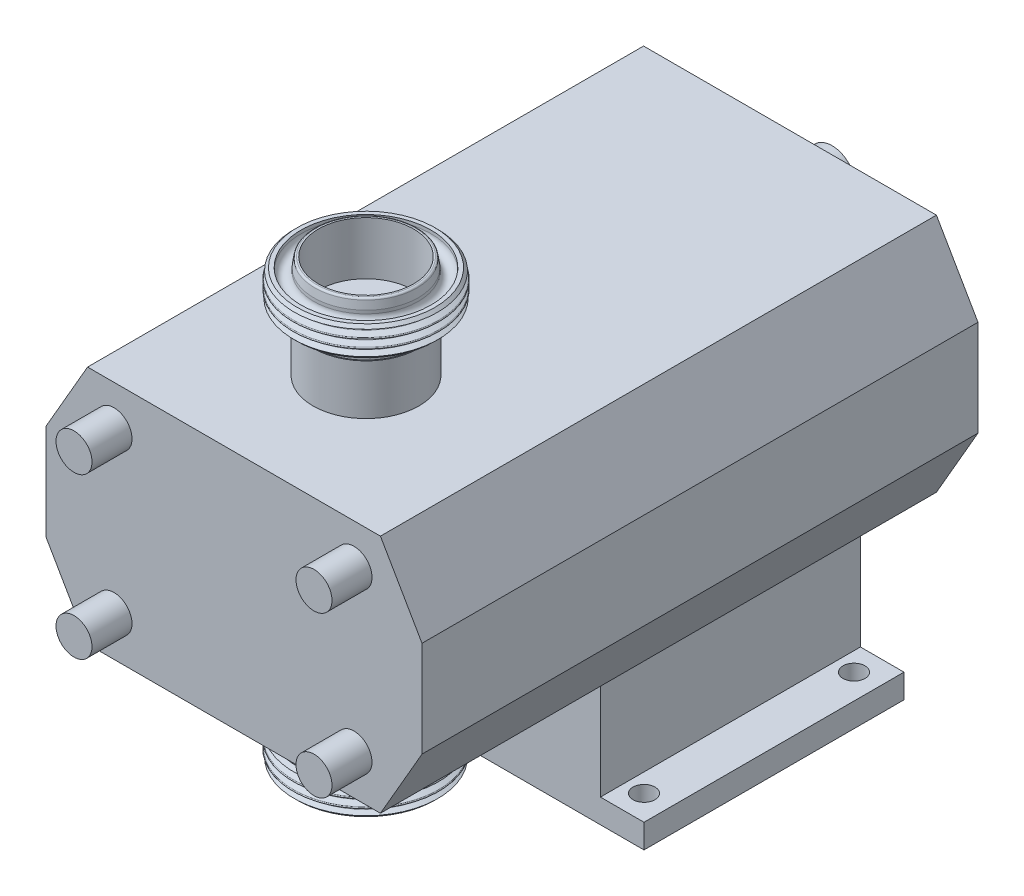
ISO-10303-21;
HEADER;
FILE_DESCRIPTION(('STEP AP214'),'2;1');
FILE_NAME('part.step','',(''),(''),'','','');
FILE_SCHEMA(('AUTOMOTIVE_DESIGN { 1 0 10303 214 1 1 1 1 }'));
ENDSEC;
DATA;
#1=APPLICATION_CONTEXT('core data for automotive mechanical design processes');
#2=APPLICATION_PROTOCOL_DEFINITION('international standard','automotive_design',2000,#1);
#3=PRODUCT_CONTEXT('',#1,'mechanical');
#4=PRODUCT('Part','Part','',(#3));
#5=PRODUCT_RELATED_PRODUCT_CATEGORY('part','',(#4));
#6=PRODUCT_DEFINITION_FORMATION('','',#4);
#7=PRODUCT_DEFINITION_CONTEXT('part definition',#1,'design');
#8=PRODUCT_DEFINITION('design','',#6,#7);
#9=PRODUCT_DEFINITION_SHAPE('','',#8);
#10=(LENGTH_UNIT() NAMED_UNIT(*) SI_UNIT(.MILLI.,.METRE.));
#11=(NAMED_UNIT(*) PLANE_ANGLE_UNIT() SI_UNIT($,.RADIAN.));
#12=(NAMED_UNIT(*) SI_UNIT($,.STERADIAN.) SOLID_ANGLE_UNIT());
#13=UNCERTAINTY_MEASURE_WITH_UNIT(LENGTH_MEASURE(1.E-05),#10,'distance_accuracy_value','');
#14=(GEOMETRIC_REPRESENTATION_CONTEXT(3) GLOBAL_UNCERTAINTY_ASSIGNED_CONTEXT((#13)) GLOBAL_UNIT_ASSIGNED_CONTEXT((#10,
#11,#12)) REPRESENTATION_CONTEXT('',''));
#15=CARTESIAN_POINT('',(0.,0.,0.));
#16=DIRECTION('',(0.,0.,1.));
#17=DIRECTION('',(1.,0.,0.));
#18=AXIS2_PLACEMENT_3D('',#15,#16,#17);
#19=CARTESIAN_POINT('',(-32.2594583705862,18.4261984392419,139.232657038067));
#20=DIRECTION('',(0.,0.,1.));
#21=DIRECTION('',(1.,0.,0.));
#22=AXIS2_PLACEMENT_3D('',#19,#20,#21);
#23=CYLINDRICAL_SURFACE('',#22,12.);
#24=CARTESIAN_POINT('',(-32.2594583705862,18.4261984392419,-104.5));
#25=DIRECTION('',(0.,0.,1.));
#26=DIRECTION('',(1.,0.,0.));
#27=AXIS2_PLACEMENT_3D('',#24,#25,#26);
#28=CIRCLE('',#27,12.);
#29=CARTESIAN_POINT('',(-20.2594583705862,18.4261984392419,-104.5));
#30=VERTEX_POINT('',#29);
#31=EDGE_CURVE('P0_E277',#30,#30,#28,.T.);
#32=ORIENTED_EDGE('',*,*,#31,.F.);
#33=EDGE_LOOP('',(#32));
#34=FACE_BOUND('',#33,.T.);
#35=DIRECTION('',(0.,0.,1.));
#36=VECTOR('',#35,1.);
#37=CARTESIAN_POINT('',(-20.9457498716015,22.4261984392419,139.232657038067));
#38=LINE('',#37,#36);
#39=CARTESIAN_POINT('',(-20.9457498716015,22.4261984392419,-154.5));
#40=VERTEX_POINT('',#39);
#41=CARTESIAN_POINT('',(-20.9457498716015,22.4261984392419,-124.5));
#42=VERTEX_POINT('',#41);
#43=EDGE_CURVE('P0_E178',#40,#42,#38,.T.);
#44=ORIENTED_EDGE('',*,*,#43,.F.);
#45=CARTESIAN_POINT('',(-32.2594583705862,18.4261984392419,-154.5));
#46=DIRECTION('',(0.,0.,1.));
#47=DIRECTION('',(1.,0.,0.));
#48=AXIS2_PLACEMENT_3D('',#45,#46,#47);
#49=CIRCLE('',#48,12.);
#50=CARTESIAN_POINT('',(-20.9457498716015,14.4261984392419,-154.5));
#51=VERTEX_POINT('',#50);
#52=EDGE_CURVE('P0_E176',#40,#51,#49,.T.);
#53=ORIENTED_EDGE('',*,*,#52,.T.);
#54=DIRECTION('',(0.,0.,1.));
#55=VECTOR('',#54,1.);
#56=CARTESIAN_POINT('',(-20.9457498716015,14.4261984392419,139.232657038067));
#57=LINE('',#56,#55);
#58=CARTESIAN_POINT('',(-20.9457498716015,14.4261984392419,-124.5));
#59=VERTEX_POINT('',#58);
#60=EDGE_CURVE('P0_E39',#59,#51,#57,.F.);
#61=ORIENTED_EDGE('',*,*,#60,.F.);
#62=CARTESIAN_POINT('',(-20.2594583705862,18.4261984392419,-128.5));
#63=CARTESIAN_POINT('',(-20.2594577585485,18.6444518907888,-128.500001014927));
#64=CARTESIAN_POINT('',(-20.2654675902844,18.8626992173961,-128.482078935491));
#65=CARTESIAN_POINT('',(-20.288849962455,19.2927654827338,-128.411083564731));
#66=CARTESIAN_POINT('',(-20.3062236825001,19.5045837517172,-128.358006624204));
#67=CARTESIAN_POINT('',(-20.3504460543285,19.915529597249,-128.218723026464));
#68=CARTESIAN_POINT('',(-20.3772788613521,20.114677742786,-128.132571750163));
#69=CARTESIAN_POINT('',(-20.4376805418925,20.4956981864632,-127.929835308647));
#70=CARTESIAN_POINT('',(-20.471250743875,20.6775670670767,-127.81324413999));
#71=CARTESIAN_POINT('',(-20.5428945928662,21.025165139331,-127.548696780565));
#72=CARTESIAN_POINT('',(-20.5810761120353,21.1902132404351,-127.399875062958));
#73=CARTESIAN_POINT('',(-20.6570457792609,21.4935292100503,-127.076931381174));
#74=CARTESIAN_POINT('',(-20.6948338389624,21.6317911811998,-126.902803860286));
#75=CARTESIAN_POINT('',(-20.7669250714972,21.8814982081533,-126.528059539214));
#76=CARTESIAN_POINT('',(-20.8010967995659,21.9920578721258,-126.326825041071));
#77=CARTESIAN_POINT('',(-20.860446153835,22.177473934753,-125.907295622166));
#78=CARTESIAN_POINT('',(-20.8856265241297,22.2523412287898,-125.689005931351));
#79=CARTESIAN_POINT('',(-20.923006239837,22.3616922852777,-125.249307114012));
#80=CARTESIAN_POINT('',(-20.9356145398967,22.3974522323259,-125.028251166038));
#81=CARTESIAN_POINT('',(-20.947632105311,22.4315629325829,-124.582944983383));
#82=CARTESIAN_POINT('',(-20.9470454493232,22.4299252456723,-124.358695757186));
#83=CARTESIAN_POINT('',(-20.9330977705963,22.3902780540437,-123.924253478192));
#84=CARTESIAN_POINT('',(-20.9203217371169,22.3539340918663,-123.713886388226));
#85=CARTESIAN_POINT('',(-20.8843920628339,22.2486230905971,-123.302426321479));
#86=CARTESIAN_POINT('',(-20.8612371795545,22.1796521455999,-123.101334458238));
#87=CARTESIAN_POINT('',(-20.8067419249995,22.009954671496,-122.710349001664));
#88=CARTESIAN_POINT('',(-20.7752757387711,21.9087346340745,-122.52068789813));
#89=CARTESIAN_POINT('',(-20.7077560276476,21.6777548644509,-122.160516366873));
#90=CARTESIAN_POINT('',(-20.6717011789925,21.5479868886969,-121.990011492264));
#91=CARTESIAN_POINT('',(-20.5967652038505,21.2555957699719,-121.663633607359));
#92=CARTESIAN_POINT('',(-20.5578347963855,21.0916110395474,-121.508989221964));
#93=CARTESIAN_POINT('',(-20.4831808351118,20.7395567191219,-121.229074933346));
#94=CARTESIAN_POINT('',(-20.4474575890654,20.5514848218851,-121.103807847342));
#95=CARTESIAN_POINT('',(-20.3827740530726,20.1539888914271,-120.88521479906));
#96=CARTESIAN_POINT('',(-20.3538843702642,19.9443715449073,-120.792218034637));
#97=CARTESIAN_POINT('',(-20.3066356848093,19.5112747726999,-120.643187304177));
#98=CARTESIAN_POINT('',(-20.2882730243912,19.2878001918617,-120.587140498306));
#99=CARTESIAN_POINT('',(-20.2647532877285,18.8437337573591,-120.515777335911));
#100=CARTESIAN_POINT('',(-20.2590582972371,18.6234368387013,-120.498800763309));
#101=CARTESIAN_POINT('',(-20.2599022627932,18.1830981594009,-120.501330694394));
#102=CARTESIAN_POINT('',(-20.2664391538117,17.9630563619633,-120.520831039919));
#103=CARTESIAN_POINT('',(-20.2906573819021,17.5361189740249,-120.594447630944));
#104=CARTESIAN_POINT('',(-20.3080104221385,17.3290272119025,-120.647544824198));
#105=CARTESIAN_POINT('',(-20.3517844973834,16.9267746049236,-120.785573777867));
#106=CARTESIAN_POINT('',(-20.3782066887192,16.7316152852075,-120.870509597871));
#107=CARTESIAN_POINT('',(-20.4383011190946,16.3530452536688,-121.072281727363));
#108=CARTESIAN_POINT('',(-20.4721457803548,16.1700786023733,-121.189898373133));
#109=CARTESIAN_POINT('',(-20.5432482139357,15.8259391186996,-121.452776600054));
#110=CARTESIAN_POINT('',(-20.5805070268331,15.6647729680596,-121.598046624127));
#111=CARTESIAN_POINT('',(-20.6563844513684,15.3611884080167,-121.919915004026));
#112=CARTESIAN_POINT('',(-20.6949879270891,15.2199545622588,-122.097636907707));
#113=CARTESIAN_POINT('',(-20.7674594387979,14.9691683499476,-122.475086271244));
#114=CARTESIAN_POINT('',(-20.8013274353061,14.8596162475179,-122.674813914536));
#115=CARTESIAN_POINT('',(-20.8601626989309,14.6758107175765,-123.09069206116));
#116=CARTESIAN_POINT('',(-20.8851479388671,14.6014859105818,-123.306808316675));
#117=CARTESIAN_POINT('',(-20.9230250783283,14.4906197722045,-123.749514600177));
#118=CARTESIAN_POINT('',(-20.9359224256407,14.4540614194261,-123.976099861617));
#119=CARTESIAN_POINT('',(-20.9475440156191,14.4210933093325,-124.420788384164));
#120=CARTESIAN_POINT('',(-20.9469623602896,14.4227174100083,-124.638729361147));
#121=CARTESIAN_POINT('',(-20.9334075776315,14.4612292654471,-125.071060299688));
#122=CARTESIAN_POINT('',(-20.9204351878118,14.4981149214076,-125.28545047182));
#123=CARTESIAN_POINT('',(-20.8840773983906,14.6047111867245,-125.70054265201));
#124=CARTESIAN_POINT('',(-20.8608944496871,14.6737850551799,-125.901427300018));
#125=CARTESIAN_POINT('',(-20.8068024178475,14.8422809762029,-126.288909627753));
#126=CARTESIAN_POINT('',(-20.7758916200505,14.9417097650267,-126.475504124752));
#127=CARTESIAN_POINT('',(-20.7081452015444,15.1731556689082,-126.837934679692));
#128=CARTESIAN_POINT('',(-20.6711099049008,15.3064054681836,-127.012946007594));
#129=CARTESIAN_POINT('',(-20.5961241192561,15.5996269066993,-127.338759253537));
#130=CARTESIAN_POINT('',(-20.5581733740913,15.759606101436,-127.489554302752));
#131=CARTESIAN_POINT('',(-20.4838571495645,16.1092322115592,-127.768577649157));
#132=CARTESIAN_POINT('',(-20.447611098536,16.299792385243,-127.895697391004));
#133=CARTESIAN_POINT('',(-20.3824187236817,16.7007690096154,-128.115961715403));
#134=CARTESIAN_POINT('',(-20.353470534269,16.9111803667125,-128.209114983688));
#135=CARTESIAN_POINT('',(-20.3072377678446,17.336223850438,-128.354886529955));
#136=CARTESIAN_POINT('',(-20.2894898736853,17.5502474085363,-128.409129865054));
#137=CARTESIAN_POINT('',(-20.2656020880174,17.9849167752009,-128.481681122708));
#138=CARTESIAN_POINT('',(-20.25945898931,18.2055607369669,-128.499998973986));
#139=CARTESIAN_POINT('',(-20.2594583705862,18.4261984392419,-128.5));
#140=B_SPLINE_CURVE_WITH_KNOTS('',3,(#62,#63,#64,#65,#66,#67,#68,#69,#70,#71,#72,#73,#74,#75,
#76,#77,#78,#79,#80,#81,#82,#83,#84,#85,#86,#87,#88,#89,#90,#91,#92,#93,#94,#95,#96,#97,#98,#99,
#100,#101,#102,#103,#104,#105,#106,#107,#108,#109,#110,#111,#112,#113,#114,#115,#116,#117,#118,
#119,#120,#121,#122,#123,#124,#125,#126,#127,#128,#129,#130,#131,#132,#133,#134,#135,#136,#137,
#138,#139),.UNSPECIFIED.,.T.,.F.,(4,2,2,2,2,2,2,2,2,2,2,2,2,2,2,2,2,2,2,2,2,2,2,2,2,2,2,2,2,2,2,
2,2,2,2,2,2,2,4),(0.,0.653948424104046,1.30796474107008,1.96089069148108,2.61394551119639,
3.28738737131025,3.96097733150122,4.65393539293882,5.34668178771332,6.0160770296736,
6.68526535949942,7.32387306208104,7.96255723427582,8.61152684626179,9.26068410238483,
9.94373223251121,10.6268458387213,11.3167362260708,12.0063867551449,12.6661433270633,
13.3257885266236,13.9663263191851,14.6069458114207,15.264415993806,15.9220872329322,
16.6096409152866,17.2972003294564,17.9833605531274,18.6692113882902,19.3198266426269,
19.9704031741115,20.6086234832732,21.2469855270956,21.9132026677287,22.5796084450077,
23.2719864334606,23.9641872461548,24.6254623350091,25.2865546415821),.UNSPECIFIED.);
#141=EDGE_CURVE('P0_E11',#42,#59,#140,.T.);
#142=ORIENTED_EDGE('',*,*,#141,.F.);
#143=EDGE_LOOP('',(#44,#53,#61,#142));
#144=FACE_BOUND('',#143,.T.);
#145=ADVANCED_FACE('P0_F17',(#34,#144),#23,.T.);
#146=CARTESIAN_POINT('',(-74.4748486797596,-41.5738015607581,175.5));
#147=DIRECTION('',(0.,1.,0.));
#148=DIRECTION('',(-1.,0.,0.));
#149=AXIS2_PLACEMENT_3D('',#146,#147,#148);
#150=PLANE('',#149);
#151=CARTESIAN_POINT('',(-1.25945837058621,-41.5738015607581,109.5));
#152=DIRECTION('',(0.,1.,0.));
#153=DIRECTION('',(-1.,0.,0.));
#154=AXIS2_PLACEMENT_3D('',#151,#152,#153);
#155=CIRCLE('',#154,26.5);
#156=CARTESIAN_POINT('',(-27.7594583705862,-41.5738015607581,109.5));
#157=VERTEX_POINT('',#156);
#158=EDGE_CURVE('P0_E192',#157,#157,#155,.T.);
#159=ORIENTED_EDGE('',*,*,#158,.T.);
#160=EDGE_LOOP('',(#159));
#161=FACE_BOUND('',#160,.T.);
#162=DIRECTION('',(1.,0.,0.));
#163=VECTOR('',#162,1.);
#164=CARTESIAN_POINT('',(-74.4748486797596,-41.5738015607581,-102.5));
#165=LINE('',#164,#163);
#166=CARTESIAN_POINT('',(-74.4748486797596,-41.5738015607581,-102.5));
#167=VERTEX_POINT('',#166);
#168=CARTESIAN_POINT('',(71.9559319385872,-41.5738015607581,-102.5));
#169=VERTEX_POINT('',#168);
#170=EDGE_CURVE('P0_E337',#167,#169,#165,.T.);
#171=ORIENTED_EDGE('',*,*,#170,.T.);
#172=DIRECTION('',(0.,0.,-1.));
#173=VECTOR('',#172,1.);
#174=CARTESIAN_POINT('',(71.9559319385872,-41.5738015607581,175.5));
#175=LINE('',#174,#173);
#176=CARTESIAN_POINT('',(71.9559319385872,-41.5738015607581,175.5));
#177=VERTEX_POINT('',#176);
#178=EDGE_CURVE('P0_E347',#177,#169,#175,.T.);
#179=ORIENTED_EDGE('',*,*,#178,.F.);
#180=DIRECTION('',(1.,0.,0.));
#181=VECTOR('',#180,1.);
#182=CARTESIAN_POINT('',(-74.4748486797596,-41.5738015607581,175.5));
#183=LINE('',#182,#181);
#184=CARTESIAN_POINT('',(-74.4748486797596,-41.5738015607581,175.5));
#185=VERTEX_POINT('',#184);
#186=EDGE_CURVE('P0_E320',#185,#177,#183,.T.);
#187=ORIENTED_EDGE('',*,*,#186,.F.);
#188=DIRECTION('',(0.,0.,-1.));
#189=VECTOR('',#188,1.);
#190=CARTESIAN_POINT('',(-74.4748486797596,-41.5738015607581,175.5));
#191=LINE('',#190,#189);
#192=EDGE_CURVE('P0_E350',#185,#167,#191,.T.);
#193=ORIENTED_EDGE('',*,*,#192,.T.);
#194=EDGE_LOOP('',(#171,#179,#187,#193));
#195=FACE_BOUND('',#194,.T.);
#196=DIRECTION('',(1.,0.,0.));
#197=VECTOR('',#196,1.);
#198=CARTESIAN_POINT('',(51.9559319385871,-41.5738015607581,-84.5));
#199=LINE('',#198,#197);
#200=CARTESIAN_POINT('',(-54.4748486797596,-41.5738015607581,-84.5));
#201=VERTEX_POINT('',#200);
#202=CARTESIAN_POINT('',(51.9559319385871,-41.5738015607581,-84.5));
#203=VERTEX_POINT('',#202);
#204=EDGE_CURVE('P0_E220',#201,#203,#199,.T.);
#205=ORIENTED_EDGE('',*,*,#204,.F.);
#206=DIRECTION('',(0.,0.,1.));
#207=VECTOR('',#206,1.);
#208=CARTESIAN_POINT('',(-54.4748486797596,-41.5738015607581,-84.5));
#209=LINE('',#208,#207);
#210=CARTESIAN_POINT('',(-54.4748486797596,-41.5738015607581,45.5));
#211=VERTEX_POINT('',#210);
#212=EDGE_CURVE('P0_E238',#201,#211,#209,.T.);
#213=ORIENTED_EDGE('',*,*,#212,.T.);
#214=DIRECTION('',(1.,0.,0.));
#215=VECTOR('',#214,1.);
#216=CARTESIAN_POINT('',(51.9559319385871,-41.5738015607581,45.5));
#217=LINE('',#216,#215);
#218=CARTESIAN_POINT('',(51.9559319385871,-41.5738015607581,45.5));
#219=VERTEX_POINT('',#218);
#220=EDGE_CURVE('P0_E219',#211,#219,#217,.T.);
#221=ORIENTED_EDGE('',*,*,#220,.T.);
#222=DIRECTION('',(0.,0.,1.));
#223=VECTOR('',#222,1.);
#224=CARTESIAN_POINT('',(51.9559319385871,-41.5738015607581,-84.5));
#225=LINE('',#224,#223);
#226=EDGE_CURVE('P0_E274',#203,#219,#225,.T.);
#227=ORIENTED_EDGE('',*,*,#226,.F.);
#228=EDGE_LOOP('',(#205,#213,#221,#227));
#229=FACE_BOUND('',#228,.T.);
#230=ADVANCED_FACE('P0_F392',(#161,#195,#229),#150,.F.);
#231=CARTESIAN_POINT('',(106.596948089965,18.4261984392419,-102.5));
#232=DIRECTION('',(0.,0.,1.));
#233=DIRECTION('',(1.,0.,0.));
#234=AXIS2_PLACEMENT_3D('',#231,#232,#233);
#235=PLANE('',#234);
#236=DIRECTION('',(-0.500000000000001,0.866025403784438,0.));
#237=VECTOR('',#236,1.);
#238=CARTESIAN_POINT('',(71.9559319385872,78.4261984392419,-102.5));
#239=LINE('',#238,#237);
#240=CARTESIAN_POINT('',(92.7405416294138,42.4261984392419,-102.5));
#241=VERTEX_POINT('',#240);
#242=CARTESIAN_POINT('',(71.9559319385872,78.4261984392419,-102.5));
#243=VERTEX_POINT('',#242);
#244=EDGE_CURVE('P0_E305',#241,#243,#239,.T.);
#245=ORIENTED_EDGE('',*,*,#244,.F.);
#246=DIRECTION('',(0.,1.,0.));
#247=VECTOR('',#246,1.);
#248=CARTESIAN_POINT('',(92.7405416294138,42.4261984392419,-102.5));
#249=LINE('',#248,#247);
#250=CARTESIAN_POINT('',(92.7405416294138,-5.57380156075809,-102.5));
#251=VERTEX_POINT('',#250);
#252=EDGE_CURVE('P0_E312',#251,#241,#249,.T.);
#253=ORIENTED_EDGE('',*,*,#252,.F.);
#254=DIRECTION('',(0.500000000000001,0.866025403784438,0.));
#255=VECTOR('',#254,1.);
#256=CARTESIAN_POINT('',(71.9559319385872,-41.5738015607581,-102.5));
#257=LINE('',#256,#255);
#258=EDGE_CURVE('P0_E339',#169,#251,#257,.T.);
#259=ORIENTED_EDGE('',*,*,#258,.F.);
#260=ORIENTED_EDGE('',*,*,#170,.F.);
#261=DIRECTION('',(0.500000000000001,-0.866025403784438,0.));
#262=VECTOR('',#261,1.);
#263=CARTESIAN_POINT('',(-74.4748486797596,-41.5738015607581,-102.5));
#264=LINE('',#263,#262);
#265=CARTESIAN_POINT('',(-95.2594583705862,-5.57380156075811,-102.5));
#266=VERTEX_POINT('',#265);
#267=EDGE_CURVE('P0_E335',#266,#167,#264,.T.);
#268=ORIENTED_EDGE('',*,*,#267,.F.);
#269=DIRECTION('',(0.,-1.,0.));
#270=VECTOR('',#269,1.);
#271=CARTESIAN_POINT('',(-95.2594583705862,42.4261984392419,-102.5));
#272=LINE('',#271,#270);
#273=CARTESIAN_POINT('',(-95.2594583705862,42.4261984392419,-102.5));
#274=VERTEX_POINT('',#273);
#275=EDGE_CURVE('P0_E333',#274,#266,#272,.T.);
#276=ORIENTED_EDGE('',*,*,#275,.F.);
#277=DIRECTION('',(-0.500000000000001,-0.866025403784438,0.));
#278=VECTOR('',#277,1.);
#279=CARTESIAN_POINT('',(-74.4748486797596,78.4261984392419,-102.5));
#280=LINE('',#279,#278);
#281=CARTESIAN_POINT('',(-74.4748486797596,78.4261984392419,-102.5));
#282=VERTEX_POINT('',#281);
#283=EDGE_CURVE('P0_E331',#282,#274,#280,.T.);
#284=ORIENTED_EDGE('',*,*,#283,.F.);
#285=DIRECTION('',(-1.,0.,0.));
#286=VECTOR('',#285,1.);
#287=CARTESIAN_POINT('',(-74.4748486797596,78.4261984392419,-102.5));
#288=LINE('',#287,#286);
#289=EDGE_CURVE('P0_E329',#243,#282,#288,.T.);
#290=ORIENTED_EDGE('',*,*,#289,.F.);
#291=EDGE_LOOP('',(#245,#253,#259,#260,#268,#276,#284,#290));
#292=FACE_BOUND('',#291,.T.);
#293=CARTESIAN_POINT('',(-32.2594583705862,18.4261984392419,-102.5));
#294=DIRECTION('',(0.,0.,1.));
#295=DIRECTION('',(1.,0.,0.));
#296=AXIS2_PLACEMENT_3D('',#293,#294,#295);
#297=CIRCLE('',#296,15.);
#298=CARTESIAN_POINT('',(-17.2594583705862,18.4261984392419,-102.5));
#299=VERTEX_POINT('',#298);
#300=EDGE_CURVE('P0_E29',#299,#299,#297,.F.);
#301=ORIENTED_EDGE('',*,*,#300,.F.);
#302=EDGE_LOOP('',(#301));
#303=FACE_BOUND('',#302,.T.);
#304=ADVANCED_FACE('P0_F397',(#292,#303),#235,.F.);
#305=CARTESIAN_POINT('',(106.596948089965,18.4261984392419,175.5));
#306=DIRECTION('',(0.,0.,1.));
#307=DIRECTION('',(1.,0.,0.));
#308=AXIS2_PLACEMENT_3D('',#305,#306,#307);
#309=PLANE('',#308);
#310=CARTESIAN_POINT('',(58.7405416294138,-21.5738015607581,175.5));
#311=DIRECTION('',(0.,0.,1.));
#312=DIRECTION('',(1.,0.,0.));
#313=AXIS2_PLACEMENT_3D('',#310,#311,#312);
#314=CIRCLE('',#313,9.);
#315=CARTESIAN_POINT('',(67.7405416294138,-21.5738015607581,175.5));
#316=VERTEX_POINT('',#315);
#317=EDGE_CURVE('P0_E287',#316,#316,#314,.T.);
#318=ORIENTED_EDGE('',*,*,#317,.F.);
#319=EDGE_LOOP('',(#318));
#320=FACE_BOUND('',#319,.T.);
#321=CARTESIAN_POINT('',(-61.2594583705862,58.4261984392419,175.5));
#322=DIRECTION('',(0.,0.,1.));
#323=DIRECTION('',(1.,0.,0.));
#324=AXIS2_PLACEMENT_3D('',#321,#322,#323);
#325=CIRCLE('',#324,9.);
#326=CARTESIAN_POINT('',(-52.2594583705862,58.4261984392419,175.5));
#327=VERTEX_POINT('',#326);
#328=EDGE_CURVE('P0_E299',#327,#327,#325,.T.);
#329=ORIENTED_EDGE('',*,*,#328,.F.);
#330=EDGE_LOOP('',(#329));
#331=FACE_BOUND('',#330,.T.);
#332=DIRECTION('',(-0.500000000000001,0.866025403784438,0.));
#333=VECTOR('',#332,1.);
#334=CARTESIAN_POINT('',(71.9559319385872,78.4261984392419,175.5));
#335=LINE('',#334,#333);
#336=CARTESIAN_POINT('',(92.7405416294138,42.4261984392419,175.5));
#337=VERTEX_POINT('',#336);
#338=CARTESIAN_POINT('',(71.9559319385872,78.4261984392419,175.5));
#339=VERTEX_POINT('',#338);
#340=EDGE_CURVE('P0_E308',#337,#339,#335,.T.);
#341=ORIENTED_EDGE('',*,*,#340,.T.);
#342=DIRECTION('',(-1.,0.,0.));
#343=VECTOR('',#342,1.);
#344=CARTESIAN_POINT('',(-74.4748486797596,78.4261984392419,175.5));
#345=LINE('',#344,#343);
#346=CARTESIAN_POINT('',(-74.4748486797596,78.4261984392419,175.5));
#347=VERTEX_POINT('',#346);
#348=EDGE_CURVE('P0_E311',#339,#347,#345,.T.);
#349=ORIENTED_EDGE('',*,*,#348,.T.);
#350=DIRECTION('',(-0.500000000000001,-0.866025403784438,0.));
#351=VECTOR('',#350,1.);
#352=CARTESIAN_POINT('',(-74.4748486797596,78.4261984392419,175.5));
#353=LINE('',#352,#351);
#354=CARTESIAN_POINT('',(-95.2594583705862,42.4261984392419,175.5));
#355=VERTEX_POINT('',#354);
#356=EDGE_CURVE('P0_E314',#347,#355,#353,.T.);
#357=ORIENTED_EDGE('',*,*,#356,.T.);
#358=DIRECTION('',(0.,-1.,0.));
#359=VECTOR('',#358,1.);
#360=CARTESIAN_POINT('',(-95.2594583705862,42.4261984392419,175.5));
#361=LINE('',#360,#359);
#362=CARTESIAN_POINT('',(-95.2594583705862,-5.57380156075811,175.5));
#363=VERTEX_POINT('',#362);
#364=EDGE_CURVE('P0_E316',#355,#363,#361,.T.);
#365=ORIENTED_EDGE('',*,*,#364,.T.);
#366=DIRECTION('',(0.500000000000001,-0.866025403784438,0.));
#367=VECTOR('',#366,1.);
#368=CARTESIAN_POINT('',(-74.4748486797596,-41.5738015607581,175.5));
#369=LINE('',#368,#367);
#370=EDGE_CURVE('P0_E318',#363,#185,#369,.T.);
#371=ORIENTED_EDGE('',*,*,#370,.T.);
#372=ORIENTED_EDGE('',*,*,#186,.T.);
#373=DIRECTION('',(0.500000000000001,0.866025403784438,0.));
#374=VECTOR('',#373,1.);
#375=CARTESIAN_POINT('',(71.9559319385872,-41.5738015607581,175.5));
#376=LINE('',#375,#374);
#377=CARTESIAN_POINT('',(92.7405416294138,-5.57380156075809,175.5));
#378=VERTEX_POINT('',#377);
#379=EDGE_CURVE('P0_E322',#177,#378,#376,.T.);
#380=ORIENTED_EDGE('',*,*,#379,.T.);
#381=DIRECTION('',(0.,1.,0.));
#382=VECTOR('',#381,1.);
#383=CARTESIAN_POINT('',(92.7405416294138,42.4261984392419,175.5));
#384=LINE('',#383,#382);
#385=EDGE_CURVE('P0_E324',#378,#337,#384,.T.);
#386=ORIENTED_EDGE('',*,*,#385,.T.);
#387=EDGE_LOOP('',(#341,#349,#357,#365,#371,#372,#380,#386));
#388=FACE_BOUND('',#387,.T.);
#389=CARTESIAN_POINT('',(58.7405416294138,58.4261984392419,175.5));
#390=DIRECTION('',(0.,0.,1.));
#391=DIRECTION('',(1.,0.,0.));
#392=AXIS2_PLACEMENT_3D('',#389,#390,#391);
#393=CIRCLE('',#392,9.);
#394=CARTESIAN_POINT('',(67.7405416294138,58.4261984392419,175.5));
#395=VERTEX_POINT('',#394);
#396=EDGE_CURVE('P0_E293',#395,#395,#393,.T.);
#397=ORIENTED_EDGE('',*,*,#396,.F.);
#398=EDGE_LOOP('',(#397));
#399=FACE_BOUND('',#398,.T.);
#400=CARTESIAN_POINT('',(-61.2594583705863,-21.5738015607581,175.5));
#401=DIRECTION('',(0.,0.,1.));
#402=DIRECTION('',(1.,0.,0.));
#403=AXIS2_PLACEMENT_3D('',#400,#401,#402);
#404=CIRCLE('',#403,9.);
#405=CARTESIAN_POINT('',(-52.2594583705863,-21.5738015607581,175.5));
#406=VERTEX_POINT('',#405);
#407=EDGE_CURVE('P0_E283',#406,#406,#404,.T.);
#408=ORIENTED_EDGE('',*,*,#407,.F.);
#409=EDGE_LOOP('',(#408));
#410=FACE_BOUND('',#409,.T.);
#411=ADVANCED_FACE('P0_F446',(#320,#331,#388,#399,#410),#309,.T.);
#412=CARTESIAN_POINT('',(71.9559319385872,78.4261984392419,175.5));
#413=DIRECTION('',(-0.866025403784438,-0.500000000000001,0.));
#414=DIRECTION('',(0.500000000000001,-0.866025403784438,0.));
#415=AXIS2_PLACEMENT_3D('',#412,#413,#414);
#416=PLANE('',#415);
#417=ORIENTED_EDGE('',*,*,#244,.T.);
#418=DIRECTION('',(0.,0.,-1.));
#419=VECTOR('',#418,1.);
#420=CARTESIAN_POINT('',(71.9559319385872,78.4261984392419,175.5));
#421=LINE('',#420,#419);
#422=EDGE_CURVE('P0_E362',#339,#243,#421,.T.);
#423=ORIENTED_EDGE('',*,*,#422,.F.);
#424=ORIENTED_EDGE('',*,*,#340,.F.);
#425=DIRECTION('',(0.,0.,-1.));
#426=VECTOR('',#425,1.);
#427=CARTESIAN_POINT('',(92.7405416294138,42.4261984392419,175.5));
#428=LINE('',#427,#426);
#429=EDGE_CURVE('P0_E326',#337,#241,#428,.T.);
#430=ORIENTED_EDGE('',*,*,#429,.T.);
#431=EDGE_LOOP('',(#417,#423,#424,#430));
#432=FACE_BOUND('',#431,.T.);
#433=ADVANCED_FACE('P0_F19',(#432),#416,.F.);
#434=CARTESIAN_POINT('',(-74.4748486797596,78.4261984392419,175.5));
#435=DIRECTION('',(0.,-1.,0.));
#436=DIRECTION('',(1.,0.,0.));
#437=AXIS2_PLACEMENT_3D('',#434,#435,#436);
#438=PLANE('',#437);
#439=CARTESIAN_POINT('',(-1.25945837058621,78.4261984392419,109.5));
#440=DIRECTION('',(0.,-1.,0.));
#441=DIRECTION('',(1.,0.,0.));
#442=AXIS2_PLACEMENT_3D('',#439,#440,#441);
#443=CIRCLE('',#442,26.5);
#444=CARTESIAN_POINT('',(25.2405416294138,78.4261984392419,109.5));
#445=VERTEX_POINT('',#444);
#446=EDGE_CURVE('P0_E191',#445,#445,#443,.T.);
#447=ORIENTED_EDGE('',*,*,#446,.T.);
#448=EDGE_LOOP('',(#447));
#449=FACE_BOUND('',#448,.T.);
#450=ORIENTED_EDGE('',*,*,#289,.T.);
#451=DIRECTION('',(0.,0.,-1.));
#452=VECTOR('',#451,1.);
#453=CARTESIAN_POINT('',(-74.4748486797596,78.4261984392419,175.5));
#454=LINE('',#453,#452);
#455=EDGE_CURVE('P0_E359',#347,#282,#454,.T.);
#456=ORIENTED_EDGE('',*,*,#455,.F.);
#457=ORIENTED_EDGE('',*,*,#348,.F.);
#458=ORIENTED_EDGE('',*,*,#422,.T.);
#459=EDGE_LOOP('',(#450,#456,#457,#458));
#460=FACE_BOUND('',#459,.T.);
#461=ADVANCED_FACE('P0_F369',(#449,#460),#438,.F.);
#462=CARTESIAN_POINT('',(-74.4748486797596,78.4261984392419,175.5));
#463=DIRECTION('',(0.866025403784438,-0.500000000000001,0.));
#464=DIRECTION('',(0.500000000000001,0.866025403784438,0.));
#465=AXIS2_PLACEMENT_3D('',#462,#463,#464);
#466=PLANE('',#465);
#467=ORIENTED_EDGE('',*,*,#283,.T.);
#468=DIRECTION('',(0.,0.,-1.));
#469=VECTOR('',#468,1.);
#470=CARTESIAN_POINT('',(-95.2594583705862,42.4261984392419,175.5));
#471=LINE('',#470,#469);
#472=EDGE_CURVE('P0_E356',#355,#274,#471,.T.);
#473=ORIENTED_EDGE('',*,*,#472,.F.);
#474=ORIENTED_EDGE('',*,*,#356,.F.);
#475=ORIENTED_EDGE('',*,*,#455,.T.);
#476=EDGE_LOOP('',(#467,#473,#474,#475));
#477=FACE_BOUND('',#476,.T.);
#478=ADVANCED_FACE('P0_F467',(#477),#466,.F.);
#479=CARTESIAN_POINT('',(-95.2594583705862,42.4261984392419,175.5));
#480=DIRECTION('',(1.,0.,0.));
#481=DIRECTION('',(0.,0.,-1.));
#482=AXIS2_PLACEMENT_3D('',#479,#480,#481);
#483=PLANE('',#482);
#484=ORIENTED_EDGE('',*,*,#275,.T.);
#485=DIRECTION('',(0.,0.,-1.));
#486=VECTOR('',#485,1.);
#487=CARTESIAN_POINT('',(-95.2594583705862,-5.57380156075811,175.5));
#488=LINE('',#487,#486);
#489=EDGE_CURVE('P0_E353',#363,#266,#488,.T.);
#490=ORIENTED_EDGE('',*,*,#489,.F.);
#491=ORIENTED_EDGE('',*,*,#364,.F.);
#492=ORIENTED_EDGE('',*,*,#472,.T.);
#493=EDGE_LOOP('',(#484,#490,#491,#492));
#494=FACE_BOUND('',#493,.T.);
#495=ADVANCED_FACE('P0_F463',(#494),#483,.F.);
#496=CARTESIAN_POINT('',(-74.4748486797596,-41.5738015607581,175.5));
#497=DIRECTION('',(0.866025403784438,0.500000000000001,0.));
#498=DIRECTION('',(-0.500000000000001,0.866025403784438,0.));
#499=AXIS2_PLACEMENT_3D('',#496,#497,#498);
#500=PLANE('',#499);
#501=ORIENTED_EDGE('',*,*,#267,.T.);
#502=ORIENTED_EDGE('',*,*,#192,.F.);
#503=ORIENTED_EDGE('',*,*,#370,.F.);
#504=ORIENTED_EDGE('',*,*,#489,.T.);
#505=EDGE_LOOP('',(#501,#502,#503,#504));
#506=FACE_BOUND('',#505,.T.);
#507=ADVANCED_FACE('P0_F458',(#506),#500,.F.);
#508=CARTESIAN_POINT('',(71.9559319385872,-41.5738015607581,175.5));
#509=DIRECTION('',(-0.866025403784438,0.500000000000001,0.));
#510=DIRECTION('',(-0.500000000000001,-0.866025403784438,0.));
#511=AXIS2_PLACEMENT_3D('',#508,#509,#510);
#512=PLANE('',#511);
#513=ORIENTED_EDGE('',*,*,#258,.T.);
#514=DIRECTION('',(0.,0.,-1.));
#515=VECTOR('',#514,1.);
#516=CARTESIAN_POINT('',(92.7405416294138,-5.57380156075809,175.5));
#517=LINE('',#516,#515);
#518=EDGE_CURVE('P0_E344',#378,#251,#517,.T.);
#519=ORIENTED_EDGE('',*,*,#518,.F.);
#520=ORIENTED_EDGE('',*,*,#379,.F.);
#521=ORIENTED_EDGE('',*,*,#178,.T.);
#522=EDGE_LOOP('',(#513,#519,#520,#521));
#523=FACE_BOUND('',#522,.T.);
#524=ADVANCED_FACE('P0_F455',(#523),#512,.F.);
#525=CARTESIAN_POINT('',(92.7405416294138,42.4261984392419,175.5));
#526=DIRECTION('',(-1.,0.,0.));
#527=DIRECTION('',(0.,0.,1.));
#528=AXIS2_PLACEMENT_3D('',#525,#526,#527);
#529=PLANE('',#528);
#530=ORIENTED_EDGE('',*,*,#252,.T.);
#531=ORIENTED_EDGE('',*,*,#429,.F.);
#532=ORIENTED_EDGE('',*,*,#385,.F.);
#533=ORIENTED_EDGE('',*,*,#518,.T.);
#534=EDGE_LOOP('',(#530,#531,#532,#533));
#535=FACE_BOUND('',#534,.T.);
#536=ADVANCED_FACE('P0_F444',(#535),#529,.F.);
#537=CARTESIAN_POINT('',(-61.2594583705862,58.4261984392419,195.5));
#538=DIRECTION('',(0.,0.,-1.));
#539=DIRECTION('',(-1.,0.,0.));
#540=AXIS2_PLACEMENT_3D('',#537,#538,#539);
#541=CYLINDRICAL_SURFACE('',#540,9.);
#542=CARTESIAN_POINT('',(-61.2594583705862,58.4261984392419,195.5));
#543=DIRECTION('',(0.,0.,1.));
#544=DIRECTION('',(1.,0.,0.));
#545=AXIS2_PLACEMENT_3D('',#542,#543,#544);
#546=CIRCLE('',#545,9.);
#547=CARTESIAN_POINT('',(-52.2594583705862,58.4261984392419,195.5));
#548=VERTEX_POINT('',#547);
#549=EDGE_CURVE('P0_E302',#548,#548,#546,.T.);
#550=ORIENTED_EDGE('',*,*,#549,.F.);
#551=EDGE_LOOP('',(#550));
#552=FACE_BOUND('',#551,.T.);
#553=ORIENTED_EDGE('',*,*,#328,.T.);
#554=EDGE_LOOP('',(#553));
#555=FACE_BOUND('',#554,.T.);
#556=ADVANCED_FACE('P0_F440',(#552,#555),#541,.T.);
#557=CARTESIAN_POINT('',(-61.2594583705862,58.4261984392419,195.5));
#558=DIRECTION('',(0.,0.,1.));
#559=DIRECTION('',(1.,0.,0.));
#560=AXIS2_PLACEMENT_3D('',#557,#558,#559);
#561=PLANE('',#560);
#562=ORIENTED_EDGE('',*,*,#549,.T.);
#563=EDGE_LOOP('',(#562));
#564=FACE_BOUND('',#563,.T.);
#565=ADVANCED_FACE('P0_F436',(#564),#561,.T.);
#566=CARTESIAN_POINT('',(58.7405416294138,58.4261984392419,195.5));
#567=DIRECTION('',(0.,0.,-1.));
#568=DIRECTION('',(-1.,0.,0.));
#569=AXIS2_PLACEMENT_3D('',#566,#567,#568);
#570=CYLINDRICAL_SURFACE('',#569,9.);
#571=CARTESIAN_POINT('',(58.7405416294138,58.4261984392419,195.5));
#572=DIRECTION('',(0.,0.,1.));
#573=DIRECTION('',(1.,0.,0.));
#574=AXIS2_PLACEMENT_3D('',#571,#572,#573);
#575=CIRCLE('',#574,9.);
#576=CARTESIAN_POINT('',(67.7405416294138,58.4261984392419,195.5));
#577=VERTEX_POINT('',#576);
#578=EDGE_CURVE('P0_E296',#577,#577,#575,.T.);
#579=ORIENTED_EDGE('',*,*,#578,.F.);
#580=EDGE_LOOP('',(#579));
#581=FACE_BOUND('',#580,.T.);
#582=ORIENTED_EDGE('',*,*,#396,.T.);
#583=EDGE_LOOP('',(#582));
#584=FACE_BOUND('',#583,.T.);
#585=ADVANCED_FACE('P0_F432',(#581,#584),#570,.T.);
#586=CARTESIAN_POINT('',(58.7405416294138,58.4261984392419,195.5));
#587=DIRECTION('',(0.,0.,1.));
#588=DIRECTION('',(1.,0.,0.));
#589=AXIS2_PLACEMENT_3D('',#586,#587,#588);
#590=PLANE('',#589);
#591=ORIENTED_EDGE('',*,*,#578,.T.);
#592=EDGE_LOOP('',(#591));
#593=FACE_BOUND('',#592,.T.);
#594=ADVANCED_FACE('P0_F428',(#593),#590,.T.);
#595=CARTESIAN_POINT('',(58.7405416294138,-21.5738015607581,195.5));
#596=DIRECTION('',(0.,0.,-1.));
#597=DIRECTION('',(-1.,0.,0.));
#598=AXIS2_PLACEMENT_3D('',#595,#596,#597);
#599=CYLINDRICAL_SURFACE('',#598,9.);
#600=CARTESIAN_POINT('',(58.7405416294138,-21.5738015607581,195.5));
#601=DIRECTION('',(0.,0.,1.));
#602=DIRECTION('',(1.,0.,0.));
#603=AXIS2_PLACEMENT_3D('',#600,#601,#602);
#604=CIRCLE('',#603,9.);
#605=CARTESIAN_POINT('',(67.7405416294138,-21.5738015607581,195.5));
#606=VERTEX_POINT('',#605);
#607=EDGE_CURVE('P0_E290',#606,#606,#604,.T.);
#608=ORIENTED_EDGE('',*,*,#607,.F.);
#609=EDGE_LOOP('',(#608));
#610=FACE_BOUND('',#609,.T.);
#611=ORIENTED_EDGE('',*,*,#317,.T.);
#612=EDGE_LOOP('',(#611));
#613=FACE_BOUND('',#612,.T.);
#614=ADVANCED_FACE('P0_F424',(#610,#613),#599,.T.);
#615=CARTESIAN_POINT('',(58.7405416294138,-21.5738015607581,195.5));
#616=DIRECTION('',(0.,0.,1.));
#617=DIRECTION('',(1.,0.,0.));
#618=AXIS2_PLACEMENT_3D('',#615,#616,#617);
#619=PLANE('',#618);
#620=ORIENTED_EDGE('',*,*,#607,.T.);
#621=EDGE_LOOP('',(#620));
#622=FACE_BOUND('',#621,.T.);
#623=ADVANCED_FACE('P0_F420',(#622),#619,.T.);
#624=CARTESIAN_POINT('',(-61.2594583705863,-21.5738015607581,195.5));
#625=DIRECTION('',(0.,0.,-1.));
#626=DIRECTION('',(-1.,0.,0.));
#627=AXIS2_PLACEMENT_3D('',#624,#625,#626);
#628=CYLINDRICAL_SURFACE('',#627,9.);
#629=CARTESIAN_POINT('',(-61.2594583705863,-21.5738015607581,195.5));
#630=DIRECTION('',(0.,0.,1.));
#631=DIRECTION('',(1.,0.,0.));
#632=AXIS2_PLACEMENT_3D('',#629,#630,#631);
#633=CIRCLE('',#632,9.);
#634=CARTESIAN_POINT('',(-52.2594583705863,-21.5738015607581,195.5));
#635=VERTEX_POINT('',#634);
#636=EDGE_CURVE('P0_E284',#635,#635,#633,.T.);
#637=ORIENTED_EDGE('',*,*,#636,.F.);
#638=EDGE_LOOP('',(#637));
#639=FACE_BOUND('',#638,.T.);
#640=ORIENTED_EDGE('',*,*,#407,.T.);
#641=EDGE_LOOP('',(#640));
#642=FACE_BOUND('',#641,.T.);
#643=ADVANCED_FACE('P0_F416',(#639,#642),#628,.T.);
#644=CARTESIAN_POINT('',(-61.2594583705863,-21.5738015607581,195.5));
#645=DIRECTION('',(0.,0.,1.));
#646=DIRECTION('',(1.,0.,0.));
#647=AXIS2_PLACEMENT_3D('',#644,#645,#646);
#648=PLANE('',#647);
#649=ORIENTED_EDGE('',*,*,#636,.T.);
#650=EDGE_LOOP('',(#649));
#651=FACE_BOUND('',#650,.T.);
#652=ADVANCED_FACE('P0_F412',(#651),#648,.T.);
#653=CARTESIAN_POINT('',(-32.2594583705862,18.4261984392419,139.232657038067));
#654=DIRECTION('',(0.,0.,1.));
#655=DIRECTION('',(1.,0.,0.));
#656=AXIS2_PLACEMENT_3D('',#653,#654,#655);
#657=CYLINDRICAL_SURFACE('',#656,15.);
#658=ORIENTED_EDGE('',*,*,#300,.T.);
#659=EDGE_LOOP('',(#658));
#660=FACE_BOUND('',#659,.T.);
#661=CARTESIAN_POINT('',(-32.2594583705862,18.4261984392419,-104.5));
#662=DIRECTION('',(0.,0.,1.));
#663=DIRECTION('',(1.,0.,0.));
#664=AXIS2_PLACEMENT_3D('',#661,#662,#663);
#665=CIRCLE('',#664,15.);
#666=CARTESIAN_POINT('',(-17.2594583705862,18.4261984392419,-104.5));
#667=VERTEX_POINT('',#666);
#668=EDGE_CURVE('P0_E280',#667,#667,#665,.T.);
#669=ORIENTED_EDGE('',*,*,#668,.T.);
#670=EDGE_LOOP('',(#669));
#671=FACE_BOUND('',#670,.T.);
#672=ADVANCED_FACE('P0_F408',(#660,#671),#657,.T.);
#673=CARTESIAN_POINT('',(-32.2594583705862,33.4261984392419,-104.5));
#674=DIRECTION('',(0.,0.,1.));
#675=DIRECTION('',(1.,0.,0.));
#676=AXIS2_PLACEMENT_3D('',#673,#674,#675);
#677=PLANE('',#676);
#678=ORIENTED_EDGE('',*,*,#668,.F.);
#679=EDGE_LOOP('',(#678));
#680=FACE_BOUND('',#679,.T.);
#681=ORIENTED_EDGE('',*,*,#31,.T.);
#682=EDGE_LOOP('',(#681));
#683=FACE_BOUND('',#682,.T.);
#684=ADVANCED_FACE('P0_F405',(#680,#683),#677,.F.);
#685=CARTESIAN_POINT('',(-32.2594583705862,30.4261984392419,-154.5));
#686=DIRECTION('',(0.,0.,1.));
#687=DIRECTION('',(1.,0.,0.));
#688=AXIS2_PLACEMENT_3D('',#685,#686,#687);
#689=PLANE('',#688);
#690=ORIENTED_EDGE('',*,*,#52,.F.);
#691=DIRECTION('',(-1.,0.,0.));
#692=VECTOR('',#691,1.);
#693=CARTESIAN_POINT('',(-17.2594583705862,22.4261984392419,-154.5));
#694=LINE('',#693,#692);
#695=CARTESIAN_POINT('',(-17.2594583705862,22.4261984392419,-154.5));
#696=VERTEX_POINT('',#695);
#697=EDGE_CURVE('P0_E158',#696,#40,#694,.T.);
#698=ORIENTED_EDGE('',*,*,#697,.F.);
#699=DIRECTION('',(0.,1.,0.));
#700=VECTOR('',#699,1.);
#701=CARTESIAN_POINT('',(-17.2594583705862,22.4261984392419,-154.5));
#702=LINE('',#701,#700);
#703=CARTESIAN_POINT('',(-17.2594583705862,14.4261984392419,-154.5));
#704=VERTEX_POINT('',#703);
#705=EDGE_CURVE('P0_E164',#704,#696,#702,.T.);
#706=ORIENTED_EDGE('',*,*,#705,.F.);
#707=DIRECTION('',(-1.,0.,0.));
#708=VECTOR('',#707,1.);
#709=CARTESIAN_POINT('',(-17.2594583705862,14.4261984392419,-154.5));
#710=LINE('',#709,#708);
#711=EDGE_CURVE('P0_E768',#704,#51,#710,.T.);
#712=ORIENTED_EDGE('',*,*,#711,.T.);
#713=EDGE_LOOP('',(#690,#698,#706,#712));
#714=FACE_BOUND('',#713,.T.);
#715=ADVANCED_FACE('P0_F175',(#714),#689,.F.);
#716=CARTESIAN_POINT('',(51.9559319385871,-41.5738015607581,-84.5));
#717=DIRECTION('',(-1.,0.,0.));
#718=DIRECTION('',(0.,-1.,0.));
#719=AXIS2_PLACEMENT_3D('',#716,#717,#718);
#720=PLANE('',#719);
#721=DIRECTION('',(0.,-1.,0.));
#722=VECTOR('',#721,1.);
#723=CARTESIAN_POINT('',(51.9559319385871,-41.5738015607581,45.5));
#724=LINE('',#723,#722);
#725=CARTESIAN_POINT('',(51.9559319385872,-109.573801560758,45.5));
#726=VERTEX_POINT('',#725);
#727=EDGE_CURVE('P0_E241',#219,#726,#724,.T.);
#728=ORIENTED_EDGE('',*,*,#727,.T.);
#729=DIRECTION('',(0.,0.,1.));
#730=VECTOR('',#729,1.);
#731=CARTESIAN_POINT('',(51.9559319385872,-109.573801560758,-84.5));
#732=LINE('',#731,#730);
#733=CARTESIAN_POINT('',(51.9559319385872,-109.573801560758,-84.5));
#734=VERTEX_POINT('',#733);
#735=EDGE_CURVE('P0_E271',#734,#726,#732,.T.);
#736=ORIENTED_EDGE('',*,*,#735,.F.);
#737=DIRECTION('',(0.,-1.,0.));
#738=VECTOR('',#737,1.);
#739=CARTESIAN_POINT('',(51.9559319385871,-41.5738015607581,-84.5));
#740=LINE('',#739,#738);
#741=EDGE_CURVE('P0_E223',#203,#734,#740,.T.);
#742=ORIENTED_EDGE('',*,*,#741,.F.);
#743=ORIENTED_EDGE('',*,*,#226,.T.);
#744=EDGE_LOOP('',(#728,#736,#742,#743));
#745=FACE_BOUND('',#744,.T.);
#746=ADVANCED_FACE('P0_F525',(#745),#720,.F.);
#747=CARTESIAN_POINT('',(51.9559319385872,-109.573801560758,-84.5));
#748=DIRECTION('',(0.,-1.,0.));
#749=DIRECTION('',(1.,0.,0.));
#750=AXIS2_PLACEMENT_3D('',#747,#748,#749);
#751=PLANE('',#750);
#752=CARTESIAN_POINT('',(61.2405416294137,-109.573801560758,-72.));
#753=DIRECTION('',(0.,-1.,0.));
#754=DIRECTION('',(1.,0.,0.));
#755=AXIS2_PLACEMENT_3D('',#752,#753,#754);
#756=CIRCLE('',#755,5.5);
#757=CARTESIAN_POINT('',(66.7405416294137,-109.573801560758,-72.));
#758=VERTEX_POINT('',#757);
#759=EDGE_CURVE('P0_E207',#758,#758,#756,.F.);
#760=ORIENTED_EDGE('',*,*,#759,.F.);
#761=EDGE_LOOP('',(#760));
#762=FACE_BOUND('',#761,.T.);
#763=CARTESIAN_POINT('',(61.2405416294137,-109.573801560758,33.));
#764=DIRECTION('',(0.,-1.,0.));
#765=DIRECTION('',(1.,0.,0.));
#766=AXIS2_PLACEMENT_3D('',#763,#764,#765);
#767=CIRCLE('',#766,5.5);
#768=CARTESIAN_POINT('',(66.7405416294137,-109.573801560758,33.));
#769=VERTEX_POINT('',#768);
#770=EDGE_CURVE('P0_E213',#769,#769,#767,.F.);
#771=ORIENTED_EDGE('',*,*,#770,.F.);
#772=EDGE_LOOP('',(#771));
#773=FACE_BOUND('',#772,.T.);
#774=DIRECTION('',(1.,0.,0.));
#775=VECTOR('',#774,1.);
#776=CARTESIAN_POINT('',(51.9559319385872,-109.573801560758,45.5));
#777=LINE('',#776,#775);
#778=CARTESIAN_POINT('',(73.7405416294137,-109.573801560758,45.5));
#779=VERTEX_POINT('',#778);
#780=EDGE_CURVE('P0_E243',#726,#779,#777,.T.);
#781=ORIENTED_EDGE('',*,*,#780,.T.);
#782=DIRECTION('',(0.,0.,1.));
#783=VECTOR('',#782,1.);
#784=CARTESIAN_POINT('',(73.7405416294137,-109.573801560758,-84.5));
#785=LINE('',#784,#783);
#786=CARTESIAN_POINT('',(73.7405416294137,-109.573801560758,-84.5));
#787=VERTEX_POINT('',#786);
#788=EDGE_CURVE('P0_E268',#787,#779,#785,.T.);
#789=ORIENTED_EDGE('',*,*,#788,.F.);
#790=DIRECTION('',(1.,0.,0.));
#791=VECTOR('',#790,1.);
#792=CARTESIAN_POINT('',(51.9559319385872,-109.573801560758,-84.5));
#793=LINE('',#792,#791);
#794=EDGE_CURVE('P0_E226',#734,#787,#793,.T.);
#795=ORIENTED_EDGE('',*,*,#794,.F.);
#796=ORIENTED_EDGE('',*,*,#735,.T.);
#797=EDGE_LOOP('',(#781,#789,#795,#796));
#798=FACE_BOUND('',#797,.T.);
#799=ADVANCED_FACE('P0_F528',(#762,#773,#798),#751,.F.);
#800=CARTESIAN_POINT('',(73.7405416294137,-109.573801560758,-84.5));
#801=DIRECTION('',(-1.,0.,0.));
#802=DIRECTION('',(0.,-1.,0.));
#803=AXIS2_PLACEMENT_3D('',#800,#801,#802);
#804=PLANE('',#803);
#805=DIRECTION('',(0.,-1.,0.));
#806=VECTOR('',#805,1.);
#807=CARTESIAN_POINT('',(73.7405416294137,-109.573801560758,45.5));
#808=LINE('',#807,#806);
#809=CARTESIAN_POINT('',(73.7405416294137,-121.573801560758,45.5));
#810=VERTEX_POINT('',#809);
#811=EDGE_CURVE('P0_E245',#779,#810,#808,.T.);
#812=ORIENTED_EDGE('',*,*,#811,.T.);
#813=DIRECTION('',(0.,0.,1.));
#814=VECTOR('',#813,1.);
#815=CARTESIAN_POINT('',(73.7405416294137,-121.573801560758,-84.5));
#816=LINE('',#815,#814);
#817=CARTESIAN_POINT('',(73.7405416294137,-121.573801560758,-84.5));
#818=VERTEX_POINT('',#817);
#819=EDGE_CURVE('P0_E265',#818,#810,#816,.T.);
#820=ORIENTED_EDGE('',*,*,#819,.F.);
#821=DIRECTION('',(0.,-1.,0.));
#822=VECTOR('',#821,1.);
#823=CARTESIAN_POINT('',(73.7405416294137,-109.573801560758,-84.5));
#824=LINE('',#823,#822);
#825=EDGE_CURVE('P0_E228',#787,#818,#824,.T.);
#826=ORIENTED_EDGE('',*,*,#825,.F.);
#827=ORIENTED_EDGE('',*,*,#788,.T.);
#828=EDGE_LOOP('',(#812,#820,#826,#827));
#829=FACE_BOUND('',#828,.T.);
#830=ADVANCED_FACE('P0_F535',(#829),#804,.F.);
#831=CARTESIAN_POINT('',(73.7405416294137,-121.573801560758,-84.5));
#832=DIRECTION('',(0.,1.,0.));
#833=DIRECTION('',(-1.,0.,0.));
#834=AXIS2_PLACEMENT_3D('',#831,#832,#833);
#835=PLANE('',#834);
#836=CARTESIAN_POINT('',(-63.7594583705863,-121.573801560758,33.));
#837=DIRECTION('',(0.,-1.,0.));
#838=DIRECTION('',(1.,0.,0.));
#839=AXIS2_PLACEMENT_3D('',#836,#837,#838);
#840=CIRCLE('',#839,5.5);
#841=CARTESIAN_POINT('',(-58.2594583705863,-121.573801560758,33.));
#842=VERTEX_POINT('',#841);
#843=EDGE_CURVE('P0_E198',#842,#842,#840,.T.);
#844=ORIENTED_EDGE('',*,*,#843,.F.);
#845=EDGE_LOOP('',(#844));
#846=FACE_BOUND('',#845,.T.);
#847=CARTESIAN_POINT('',(-63.7594583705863,-121.573801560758,-72.));
#848=DIRECTION('',(0.,-1.,0.));
#849=DIRECTION('',(1.,0.,0.));
#850=AXIS2_PLACEMENT_3D('',#847,#848,#849);
#851=CIRCLE('',#850,5.5);
#852=CARTESIAN_POINT('',(-58.2594583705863,-121.573801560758,-72.));
#853=VERTEX_POINT('',#852);
#854=EDGE_CURVE('P0_E204',#853,#853,#851,.T.);
#855=ORIENTED_EDGE('',*,*,#854,.F.);
#856=EDGE_LOOP('',(#855));
#857=FACE_BOUND('',#856,.T.);
#858=CARTESIAN_POINT('',(61.2405416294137,-121.573801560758,-72.));
#859=DIRECTION('',(0.,-1.,0.));
#860=DIRECTION('',(1.,0.,0.));
#861=AXIS2_PLACEMENT_3D('',#858,#859,#860);
#862=CIRCLE('',#861,5.5);
#863=CARTESIAN_POINT('',(66.7405416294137,-121.573801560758,-72.));
#864=VERTEX_POINT('',#863);
#865=EDGE_CURVE('P0_E210',#864,#864,#862,.T.);
#866=ORIENTED_EDGE('',*,*,#865,.F.);
#867=EDGE_LOOP('',(#866));
#868=FACE_BOUND('',#867,.T.);
#869=CARTESIAN_POINT('',(61.2405416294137,-121.573801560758,33.));
#870=DIRECTION('',(0.,-1.,0.));
#871=DIRECTION('',(1.,0.,0.));
#872=AXIS2_PLACEMENT_3D('',#869,#870,#871);
#873=CIRCLE('',#872,5.5);
#874=CARTESIAN_POINT('',(66.7405416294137,-121.573801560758,33.));
#875=VERTEX_POINT('',#874);
#876=EDGE_CURVE('P0_E216',#875,#875,#873,.T.);
#877=ORIENTED_EDGE('',*,*,#876,.F.);
#878=EDGE_LOOP('',(#877));
#879=FACE_BOUND('',#878,.T.);
#880=DIRECTION('',(-1.,0.,0.));
#881=VECTOR('',#880,1.);
#882=CARTESIAN_POINT('',(73.7405416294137,-121.573801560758,45.5));
#883=LINE('',#882,#881);
#884=CARTESIAN_POINT('',(-76.2594583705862,-121.573801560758,45.5));
#885=VERTEX_POINT('',#884);
#886=EDGE_CURVE('P0_E247',#810,#885,#883,.T.);
#887=ORIENTED_EDGE('',*,*,#886,.T.);
#888=DIRECTION('',(0.,0.,1.));
#889=VECTOR('',#888,1.);
#890=CARTESIAN_POINT('',(-76.2594583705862,-121.573801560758,-84.5));
#891=LINE('',#890,#889);
#892=CARTESIAN_POINT('',(-76.2594583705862,-121.573801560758,-84.5));
#893=VERTEX_POINT('',#892);
#894=EDGE_CURVE('P0_E262',#893,#885,#891,.T.);
#895=ORIENTED_EDGE('',*,*,#894,.F.);
#896=DIRECTION('',(-1.,0.,0.));
#897=VECTOR('',#896,1.);
#898=CARTESIAN_POINT('',(73.7405416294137,-121.573801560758,-84.5));
#899=LINE('',#898,#897);
#900=EDGE_CURVE('P0_E230',#818,#893,#899,.T.);
#901=ORIENTED_EDGE('',*,*,#900,.F.);
#902=ORIENTED_EDGE('',*,*,#819,.T.);
#903=EDGE_LOOP('',(#887,#895,#901,#902));
#904=FACE_BOUND('',#903,.T.);
#905=ADVANCED_FACE('P0_F538',(#846,#857,#868,#879,#904),#835,.F.);
#906=CARTESIAN_POINT('',(-76.2594583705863,-109.573801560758,-84.5));
#907=DIRECTION('',(1.,0.,0.));
#908=DIRECTION('',(0.,1.,0.));
#909=AXIS2_PLACEMENT_3D('',#906,#907,#908);
#910=PLANE('',#909);
#911=DIRECTION('',(0.,1.,0.));
#912=VECTOR('',#911,1.);
#913=CARTESIAN_POINT('',(-76.2594583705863,-109.573801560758,45.5));
#914=LINE('',#913,#912);
#915=CARTESIAN_POINT('',(-76.2594583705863,-109.573801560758,45.5));
#916=VERTEX_POINT('',#915);
#917=EDGE_CURVE('P0_E249',#885,#916,#914,.T.);
#918=ORIENTED_EDGE('',*,*,#917,.T.);
#919=DIRECTION('',(0.,0.,1.));
#920=VECTOR('',#919,1.);
#921=CARTESIAN_POINT('',(-76.2594583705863,-109.573801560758,-84.5));
#922=LINE('',#921,#920);
#923=CARTESIAN_POINT('',(-76.2594583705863,-109.573801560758,-84.5));
#924=VERTEX_POINT('',#923);
#925=EDGE_CURVE('P0_E259',#924,#916,#922,.T.);
#926=ORIENTED_EDGE('',*,*,#925,.F.);
#927=DIRECTION('',(0.,1.,0.));
#928=VECTOR('',#927,1.);
#929=CARTESIAN_POINT('',(-76.2594583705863,-109.573801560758,-84.5));
#930=LINE('',#929,#928);
#931=EDGE_CURVE('P0_E232',#893,#924,#930,.T.);
#932=ORIENTED_EDGE('',*,*,#931,.F.);
#933=ORIENTED_EDGE('',*,*,#894,.T.);
#934=EDGE_LOOP('',(#918,#926,#932,#933));
#935=FACE_BOUND('',#934,.T.);
#936=ADVANCED_FACE('P0_F543',(#935),#910,.F.);
#937=CARTESIAN_POINT('',(-54.4748486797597,-109.573801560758,-84.5));
#938=DIRECTION('',(0.,-1.,0.));
#939=DIRECTION('',(0.,0.,-1.));
#940=AXIS2_PLACEMENT_3D('',#937,#938,#939);
#941=PLANE('',#940);
#942=CARTESIAN_POINT('',(-63.7594583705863,-109.573801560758,33.));
#943=DIRECTION('',(0.,-1.,0.));
#944=DIRECTION('',(0.,0.,-1.));
#945=AXIS2_PLACEMENT_3D('',#942,#943,#944);
#946=CIRCLE('',#945,5.5);
#947=CARTESIAN_POINT('',(-63.7594583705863,-109.573801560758,27.5));
#948=VERTEX_POINT('',#947);
#949=EDGE_CURVE('P0_E195',#948,#948,#946,.F.);
#950=ORIENTED_EDGE('',*,*,#949,.F.);
#951=EDGE_LOOP('',(#950));
#952=FACE_BOUND('',#951,.T.);
#953=CARTESIAN_POINT('',(-63.7594583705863,-109.573801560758,-72.));
#954=DIRECTION('',(0.,-1.,0.));
#955=DIRECTION('',(0.,0.,-1.));
#956=AXIS2_PLACEMENT_3D('',#953,#954,#955);
#957=CIRCLE('',#956,5.5);
#958=CARTESIAN_POINT('',(-63.7594583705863,-109.573801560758,-77.5));
#959=VERTEX_POINT('',#958);
#960=EDGE_CURVE('P0_E201',#959,#959,#957,.F.);
#961=ORIENTED_EDGE('',*,*,#960,.F.);
#962=EDGE_LOOP('',(#961));
#963=FACE_BOUND('',#962,.T.);
#964=DIRECTION('',(1.,0.,0.));
#965=VECTOR('',#964,1.);
#966=CARTESIAN_POINT('',(-54.4748486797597,-109.573801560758,45.5));
#967=LINE('',#966,#965);
#968=CARTESIAN_POINT('',(-54.4748486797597,-109.573801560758,45.5));
#969=VERTEX_POINT('',#968);
#970=EDGE_CURVE('P0_E251',#916,#969,#967,.T.);
#971=ORIENTED_EDGE('',*,*,#970,.T.);
#972=DIRECTION('',(0.,0.,1.));
#973=VECTOR('',#972,1.);
#974=CARTESIAN_POINT('',(-54.4748486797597,-109.573801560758,-84.5));
#975=LINE('',#974,#973);
#976=CARTESIAN_POINT('',(-54.4748486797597,-109.573801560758,-84.5));
#977=VERTEX_POINT('',#976);
#978=EDGE_CURVE('P0_E256',#977,#969,#975,.T.);
#979=ORIENTED_EDGE('',*,*,#978,.F.);
#980=DIRECTION('',(1.,0.,0.));
#981=VECTOR('',#980,1.);
#982=CARTESIAN_POINT('',(-54.4748486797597,-109.573801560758,-84.5));
#983=LINE('',#982,#981);
#984=EDGE_CURVE('P0_E234',#924,#977,#983,.T.);
#985=ORIENTED_EDGE('',*,*,#984,.F.);
#986=ORIENTED_EDGE('',*,*,#925,.T.);
#987=EDGE_LOOP('',(#971,#979,#985,#986));
#988=FACE_BOUND('',#987,.T.);
#989=ADVANCED_FACE('P0_F545',(#952,#963,#988),#941,.F.);
#990=CARTESIAN_POINT('',(-54.4748486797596,-41.5738015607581,-84.5));
#991=DIRECTION('',(1.,0.,0.));
#992=DIRECTION('',(0.,1.,0.));
#993=AXIS2_PLACEMENT_3D('',#990,#991,#992);
#994=PLANE('',#993);
#995=DIRECTION('',(0.,1.,0.));
#996=VECTOR('',#995,1.);
#997=CARTESIAN_POINT('',(-54.4748486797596,-41.5738015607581,45.5));
#998=LINE('',#997,#996);
#999=EDGE_CURVE('P0_E224',#969,#211,#998,.T.);
#1000=ORIENTED_EDGE('',*,*,#999,.T.);
#1001=ORIENTED_EDGE('',*,*,#212,.F.);
#1002=DIRECTION('',(0.,1.,0.));
#1003=VECTOR('',#1002,1.);
#1004=CARTESIAN_POINT('',(-54.4748486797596,-41.5738015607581,-84.5));
#1005=LINE('',#1004,#1003);
#1006=EDGE_CURVE('P0_E236',#977,#201,#1005,.T.);
#1007=ORIENTED_EDGE('',*,*,#1006,.F.);
#1008=ORIENTED_EDGE('',*,*,#978,.T.);
#1009=EDGE_LOOP('',(#1000,#1001,#1007,#1008));
#1010=FACE_BOUND('',#1009,.T.);
#1011=ADVANCED_FACE('P0_F515',(#1010),#994,.F.);
#1012=CARTESIAN_POINT('',(51.9559319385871,-41.5738015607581,-84.5));
#1013=DIRECTION('',(0.,0.,1.));
#1014=DIRECTION('',(1.,0.,0.));
#1015=AXIS2_PLACEMENT_3D('',#1012,#1013,#1014);
#1016=PLANE('',#1015);
#1017=ORIENTED_EDGE('',*,*,#204,.T.);
#1018=ORIENTED_EDGE('',*,*,#741,.T.);
#1019=ORIENTED_EDGE('',*,*,#794,.T.);
#1020=ORIENTED_EDGE('',*,*,#825,.T.);
#1021=ORIENTED_EDGE('',*,*,#900,.T.);
#1022=ORIENTED_EDGE('',*,*,#931,.T.);
#1023=ORIENTED_EDGE('',*,*,#984,.T.);
#1024=ORIENTED_EDGE('',*,*,#1006,.T.);
#1025=EDGE_LOOP('',(#1017,#1018,#1019,#1020,#1021,#1022,#1023,#1024));
#1026=FACE_BOUND('',#1025,.T.);
#1027=ADVANCED_FACE('P0_F509',(#1026),#1016,.F.);
#1028=CARTESIAN_POINT('',(51.9559319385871,-41.5738015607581,45.5));
#1029=DIRECTION('',(0.,0.,1.));
#1030=DIRECTION('',(1.,0.,0.));
#1031=AXIS2_PLACEMENT_3D('',#1028,#1029,#1030);
#1032=PLANE('',#1031);
#1033=ORIENTED_EDGE('',*,*,#220,.F.);
#1034=ORIENTED_EDGE('',*,*,#999,.F.);
#1035=ORIENTED_EDGE('',*,*,#970,.F.);
#1036=ORIENTED_EDGE('',*,*,#917,.F.);
#1037=ORIENTED_EDGE('',*,*,#886,.F.);
#1038=ORIENTED_EDGE('',*,*,#811,.F.);
#1039=ORIENTED_EDGE('',*,*,#780,.F.);
#1040=ORIENTED_EDGE('',*,*,#727,.F.);
#1041=EDGE_LOOP('',(#1033,#1034,#1035,#1036,#1037,#1038,#1039,#1040));
#1042=FACE_BOUND('',#1041,.T.);
#1043=ADVANCED_FACE('P0_F521',(#1042),#1032,.T.);
#1044=CARTESIAN_POINT('',(61.2405416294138,78.4271984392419,33.));
#1045=DIRECTION('',(0.,-1.,0.));
#1046=DIRECTION('',(1.,0.,0.));
#1047=AXIS2_PLACEMENT_3D('',#1044,#1045,#1046);
#1048=CYLINDRICAL_SURFACE('',#1047,5.5);
#1049=ORIENTED_EDGE('',*,*,#876,.T.);
#1050=EDGE_LOOP('',(#1049));
#1051=FACE_BOUND('',#1050,.T.);
#1052=ORIENTED_EDGE('',*,*,#770,.T.);
#1053=EDGE_LOOP('',(#1052));
#1054=FACE_BOUND('',#1053,.T.);
#1055=ADVANCED_FACE('P0_F692',(#1051,#1054),#1048,.F.);
#1056=CARTESIAN_POINT('',(61.2405416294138,78.4271984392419,-72.));
#1057=DIRECTION('',(0.,-1.,0.));
#1058=DIRECTION('',(1.,0.,0.));
#1059=AXIS2_PLACEMENT_3D('',#1056,#1057,#1058);
#1060=CYLINDRICAL_SURFACE('',#1059,5.5);
#1061=ORIENTED_EDGE('',*,*,#865,.T.);
#1062=EDGE_LOOP('',(#1061));
#1063=FACE_BOUND('',#1062,.T.);
#1064=ORIENTED_EDGE('',*,*,#759,.T.);
#1065=EDGE_LOOP('',(#1064));
#1066=FACE_BOUND('',#1065,.T.);
#1067=ADVANCED_FACE('P0_F698',(#1063,#1066),#1060,.F.);
#1068=CARTESIAN_POINT('',(-63.7594583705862,78.4271984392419,-72.));
#1069=DIRECTION('',(0.,-1.,0.));
#1070=DIRECTION('',(1.,0.,0.));
#1071=AXIS2_PLACEMENT_3D('',#1068,#1069,#1070);
#1072=CYLINDRICAL_SURFACE('',#1071,5.5);
#1073=ORIENTED_EDGE('',*,*,#854,.T.);
#1074=EDGE_LOOP('',(#1073));
#1075=FACE_BOUND('',#1074,.T.);
#1076=ORIENTED_EDGE('',*,*,#960,.T.);
#1077=EDGE_LOOP('',(#1076));
#1078=FACE_BOUND('',#1077,.T.);
#1079=ADVANCED_FACE('P0_F706',(#1075,#1078),#1072,.F.);
#1080=CARTESIAN_POINT('',(-63.7594583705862,78.4271984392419,33.));
#1081=DIRECTION('',(0.,-1.,0.));
#1082=DIRECTION('',(1.,0.,0.));
#1083=AXIS2_PLACEMENT_3D('',#1080,#1081,#1082);
#1084=CYLINDRICAL_SURFACE('',#1083,5.5);
#1085=ORIENTED_EDGE('',*,*,#843,.T.);
#1086=EDGE_LOOP('',(#1085));
#1087=FACE_BOUND('',#1086,.T.);
#1088=ORIENTED_EDGE('',*,*,#949,.T.);
#1089=EDGE_LOOP('',(#1088));
#1090=FACE_BOUND('',#1089,.T.);
#1091=ADVANCED_FACE('P0_F385',(#1087,#1090),#1084,.F.);
#1092=CARTESIAN_POINT('',(-1.25945837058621,103.426198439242,109.5));
#1093=DIRECTION('',(0.,1.,0.));
#1094=DIRECTION('',(0.,0.,1.));
#1095=AXIS2_PLACEMENT_3D('',#1092,#1093,#1094);
#1096=PLANE('',#1095);
#1097=CARTESIAN_POINT('',(-1.25945837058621,103.426198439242,109.5));
#1098=DIRECTION('',(0.,1.,0.));
#1099=DIRECTION('',(0.,0.,1.));
#1100=AXIS2_PLACEMENT_3D('',#1097,#1098,#1099);
#1101=CIRCLE('',#1100,26.5);
#1102=CARTESIAN_POINT('',(-1.25945837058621,103.426198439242,136.));
#1103=VERTEX_POINT('',#1102);
#1104=EDGE_CURVE('P0_E185',#1103,#1103,#1101,.T.);
#1105=ORIENTED_EDGE('',*,*,#1104,.T.);
#1106=EDGE_LOOP('',(#1105));
#1107=FACE_BOUND('',#1106,.T.);
#1108=ADVANCED_FACE('P0_F375',(#1107),#1096,.T.);
#1109=CARTESIAN_POINT('',(-1.25945837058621,-66.5738015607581,109.5));
#1110=DIRECTION('',(0.,1.,0.));
#1111=DIRECTION('',(0.,0.,1.));
#1112=AXIS2_PLACEMENT_3D('',#1109,#1110,#1111);
#1113=CYLINDRICAL_SURFACE('',#1112,26.5);
#1114=ORIENTED_EDGE('',*,*,#1104,.F.);
#1115=EDGE_LOOP('',(#1114));
#1116=FACE_BOUND('',#1115,.T.);
#1117=ORIENTED_EDGE('',*,*,#446,.F.);
#1118=EDGE_LOOP('',(#1117));
#1119=FACE_BOUND('',#1118,.T.);
#1120=ADVANCED_FACE('P0_F372',(#1116,#1119),#1113,.T.);
#1121=CARTESIAN_POINT('',(-1.25945837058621,-66.5738015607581,109.5));
#1122=DIRECTION('',(0.,1.,0.));
#1123=DIRECTION('',(0.,0.,1.));
#1124=AXIS2_PLACEMENT_3D('',#1121,#1122,#1123);
#1125=CIRCLE('',#1124,26.5);
#1126=CARTESIAN_POINT('',(-1.25945837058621,-66.5738015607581,136.));
#1127=VERTEX_POINT('',#1126);
#1128=EDGE_CURVE('P0_E188',#1127,#1127,#1125,.T.);
#1129=ORIENTED_EDGE('',*,*,#1128,.T.);
#1130=EDGE_LOOP('',(#1129));
#1131=FACE_BOUND('',#1130,.T.);
#1132=ORIENTED_EDGE('',*,*,#158,.F.);
#1133=EDGE_LOOP('',(#1132));
#1134=FACE_BOUND('',#1133,.T.);
#1135=ADVANCED_FACE('P0_F374',(#1131,#1134),#1113,.T.);
#1136=CARTESIAN_POINT('',(-1.25945837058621,-66.5738015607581,109.5));
#1137=DIRECTION('',(0.,1.,0.));
#1138=DIRECTION('',(0.,0.,1.));
#1139=AXIS2_PLACEMENT_3D('',#1136,#1137,#1138);
#1140=PLANE('',#1139);
#1141=ORIENTED_EDGE('',*,*,#1128,.F.);
#1142=EDGE_LOOP('',(#1141));
#1143=FACE_BOUND('',#1142,.T.);
#1144=ADVANCED_FACE('P0_F383',(#1143),#1140,.F.);
#1145=CARTESIAN_POINT('',(-17.2594583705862,18.4261984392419,-124.5));
#1146=DIRECTION('',(-1.,0.,0.));
#1147=DIRECTION('',(0.,0.,1.));
#1148=AXIS2_PLACEMENT_3D('',#1145,#1146,#1147);
#1149=CYLINDRICAL_SURFACE('',#1148,4.);
#1150=DIRECTION('',(-1.,0.,0.));
#1151=VECTOR('',#1150,1.);
#1152=CARTESIAN_POINT('',(-17.2594583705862,22.4261984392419,-124.5));
#1153=LINE('',#1152,#1151);
#1154=CARTESIAN_POINT('',(-17.2594583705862,22.4261984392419,-124.5));
#1155=VERTEX_POINT('',#1154);
#1156=EDGE_CURVE('P0_E160',#1155,#42,#1153,.T.);
#1157=ORIENTED_EDGE('',*,*,#1156,.T.);
#1158=ORIENTED_EDGE('',*,*,#141,.T.);
#1159=DIRECTION('',(-1.,0.,0.));
#1160=VECTOR('',#1159,1.);
#1161=CARTESIAN_POINT('',(-17.2594583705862,14.4261984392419,-124.5));
#1162=LINE('',#1161,#1160);
#1163=CARTESIAN_POINT('',(-17.2594583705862,14.4261984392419,-124.5));
#1164=VERTEX_POINT('',#1163);
#1165=EDGE_CURVE('P0_E180',#1164,#59,#1162,.T.);
#1166=ORIENTED_EDGE('',*,*,#1165,.F.);
#1167=CARTESIAN_POINT('',(-17.2594583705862,18.4261984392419,-124.5));
#1168=DIRECTION('',(1.,0.,0.));
#1169=DIRECTION('',(0.,0.,-1.));
#1170=AXIS2_PLACEMENT_3D('',#1167,#1168,#1169);
#1171=CIRCLE('',#1170,4.);
#1172=EDGE_CURVE('P0_E163',#1155,#1164,#1171,.T.);
#1173=ORIENTED_EDGE('',*,*,#1172,.F.);
#1174=EDGE_LOOP('',(#1157,#1158,#1166,#1173));
#1175=FACE_BOUND('',#1174,.T.);
#1176=ADVANCED_FACE('P0_F737',(#1175),#1149,.T.);
#1177=CARTESIAN_POINT('',(-17.2594583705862,22.4261984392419,-154.5));
#1178=DIRECTION('',(0.,-1.,0.));
#1179=DIRECTION('',(0.,0.,-1.));
#1180=AXIS2_PLACEMENT_3D('',#1177,#1178,#1179);
#1181=PLANE('',#1180);
#1182=ORIENTED_EDGE('',*,*,#697,.T.);
#1183=ORIENTED_EDGE('',*,*,#43,.T.);
#1184=ORIENTED_EDGE('',*,*,#1156,.F.);
#1185=DIRECTION('',(0.,0.,1.));
#1186=VECTOR('',#1185,1.);
#1187=CARTESIAN_POINT('',(-17.2594583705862,22.4261984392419,-154.5));
#1188=LINE('',#1187,#1186);
#1189=EDGE_CURVE('P0_E154',#696,#1155,#1188,.T.);
#1190=ORIENTED_EDGE('',*,*,#1189,.F.);
#1191=EDGE_LOOP('',(#1182,#1183,#1184,#1190));
#1192=FACE_BOUND('',#1191,.T.);
#1193=ADVANCED_FACE('P0_F156',(#1192),#1181,.F.);
#1194=CARTESIAN_POINT('',(-17.2594583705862,14.4261984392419,-154.5));
#1195=DIRECTION('',(0.,1.,0.));
#1196=DIRECTION('',(0.,0.,1.));
#1197=AXIS2_PLACEMENT_3D('',#1194,#1195,#1196);
#1198=PLANE('',#1197);
#1199=ORIENTED_EDGE('',*,*,#1165,.T.);
#1200=ORIENTED_EDGE('',*,*,#60,.T.);
#1201=ORIENTED_EDGE('',*,*,#711,.F.);
#1202=DIRECTION('',(0.,0.,-1.));
#1203=VECTOR('',#1202,1.);
#1204=CARTESIAN_POINT('',(-17.2594583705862,14.4261984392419,-154.5));
#1205=LINE('',#1204,#1203);
#1206=EDGE_CURVE('P0_E169',#1164,#704,#1205,.T.);
#1207=ORIENTED_EDGE('',*,*,#1206,.F.);
#1208=EDGE_LOOP('',(#1199,#1200,#1201,#1207));
#1209=FACE_BOUND('',#1208,.T.);
#1210=ADVANCED_FACE('P0_F750',(#1209),#1198,.F.);
#1211=CARTESIAN_POINT('',(-17.2594583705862,18.4261984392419,-124.5));
#1212=DIRECTION('',(1.,0.,0.));
#1213=DIRECTION('',(0.,0.,-1.));
#1214=AXIS2_PLACEMENT_3D('',#1211,#1212,#1213);
#1215=PLANE('',#1214);
#1216=ORIENTED_EDGE('',*,*,#705,.T.);
#1217=ORIENTED_EDGE('',*,*,#1189,.T.);
#1218=ORIENTED_EDGE('',*,*,#1172,.T.);
#1219=ORIENTED_EDGE('',*,*,#1206,.T.);
#1220=EDGE_LOOP('',(#1216,#1217,#1218,#1219));
#1221=FACE_BOUND('',#1220,.T.);
#1222=ADVANCED_FACE('P0_F167',(#1221),#1215,.T.);
#1223=CLOSED_SHELL('',(#145,#230,#304,#411,#433,#461,#478,#495,#507,#524,#536,#556,#565,#585,
#594,#614,#623,#643,#652,#672,#684,#715,#746,#799,#830,#905,#936,#989,#1011,#1027,#1043,#1055,
#1067,#1079,#1091,#1108,#1120,#1135,#1144,#1176,#1193,#1210,#1222));
#1224=MANIFOLD_SOLID_BREP('P0_B1',#1223);
#1225=CARTESIAN_POINT('',(-1.25945837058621,125.126198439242,109.5));
#1226=DIRECTION('',(0.,-1.,0.));
#1227=DIRECTION('',(0.908795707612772,0.,-0.417241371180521));
#1228=AXIS2_PLACEMENT_3D('',#1225,#1226,#1227);
#1229=CONICAL_SURFACE('',#1228,34.5,0.785398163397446);
#1230=CARTESIAN_POINT('',(-1.25945837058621,125.126198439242,109.5));
#1231=DIRECTION('',(0.,1.,0.));
#1232=DIRECTION('',(-0.908795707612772,0.,0.417241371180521));
#1233=AXIS2_PLACEMENT_3D('',#1230,#1231,#1232);
#1234=CIRCLE('',#1233,34.5);
#1235=CARTESIAN_POINT('',(-32.6129102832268,125.126198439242,123.894827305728));
#1236=VERTEX_POINT('',#1235);
#1237=EDGE_CURVE('P1_E53',#1236,#1236,#1234,.T.);
#1238=ORIENTED_EDGE('',*,*,#1237,.F.);
#1239=EDGE_LOOP('',(#1238));
#1240=FACE_BOUND('',#1239,.T.);
#1241=CARTESIAN_POINT('',(-1.25945837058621,123.730813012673,109.5));
#1242=DIRECTION('',(0.,1.,0.));
#1243=DIRECTION('',(-0.908795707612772,0.,0.417241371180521));
#1244=AXIS2_PLACEMENT_3D('',#1241,#1242,#1243);
#1245=CIRCLE('',#1244,35.8953854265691);
#1246=CARTESIAN_POINT('',(-33.8810305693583,123.730813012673,124.477039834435));
#1247=VERTEX_POINT('',#1246);
#1248=EDGE_CURVE('P1_E19',#1247,#1247,#1245,.T.);
#1249=ORIENTED_EDGE('',*,*,#1248,.T.);
#1250=EDGE_LOOP('',(#1249));
#1251=FACE_BOUND('',#1250,.T.);
#1252=ADVANCED_FACE('P1_F15',(#1240,#1251),#1229,.T.);
#1253=CARTESIAN_POINT('',(-1.25945837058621,112.426198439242,109.5));
#1254=DIRECTION('',(0.,1.,0.));
#1255=DIRECTION('',(-0.908795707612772,0.,0.417241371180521));
#1256=AXIS2_PLACEMENT_3D('',#1253,#1254,#1255);
#1257=CONICAL_SURFACE('',#1256,36.5,0.785398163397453);
#1258=CARTESIAN_POINT('',(-1.25945837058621,110.426198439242,109.5));
#1259=DIRECTION('',(0.,1.,0.));
#1260=DIRECTION('',(-0.908795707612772,0.,0.417241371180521));
#1261=AXIS2_PLACEMENT_3D('',#1258,#1259,#1260);
#1262=CIRCLE('',#1261,34.5);
#1263=CARTESIAN_POINT('',(-32.6129102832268,110.426198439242,123.894827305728));
#1264=VERTEX_POINT('',#1263);
#1265=EDGE_CURVE('P1_E50',#1264,#1264,#1262,.T.);
#1266=ORIENTED_EDGE('',*,*,#1265,.T.);
#1267=EDGE_LOOP('',(#1266));
#1268=FACE_BOUND('',#1267,.T.);
#1269=CARTESIAN_POINT('',(-1.25945837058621,112.064193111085,109.5));
#1270=DIRECTION('',(0.,-1.,0.));
#1271=DIRECTION('',(0.908795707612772,0.,-0.417241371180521));
#1272=AXIS2_PLACEMENT_3D('',#1269,#1270,#1271);
#1273=CIRCLE('',#1272,36.1379946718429);
#1274=CARTESIAN_POINT('',(31.5825960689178,112.064193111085,94.4217335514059));
#1275=VERTEX_POINT('',#1274);
#1276=EDGE_CURVE('P1_E31',#1275,#1275,#1273,.T.);
#1277=ORIENTED_EDGE('',*,*,#1276,.T.);
#1278=EDGE_LOOP('',(#1277));
#1279=FACE_BOUND('',#1278,.T.);
#1280=ADVANCED_FACE('P1_F98',(#1268,#1279),#1257,.T.);
#1281=CARTESIAN_POINT('',(-1.25945837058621,107.926198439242,109.5));
#1282=DIRECTION('',(0.,1.,0.));
#1283=DIRECTION('',(-0.908795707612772,0.,0.417241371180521));
#1284=AXIS2_PLACEMENT_3D('',#1281,#1282,#1283);
#1285=TOROIDAL_SURFACE('',#1284,28.5,2.5);
#1286=CARTESIAN_POINT('',(-1.25945837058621,107.926198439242,109.5));
#1287=DIRECTION('',(0.,1.,0.));
#1288=DIRECTION('',(-0.908795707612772,0.,0.417241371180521));
#1289=AXIS2_PLACEMENT_3D('',#1286,#1287,#1288);
#1290=CIRCLE('',#1289,26.);
#1291=CARTESIAN_POINT('',(-24.8881467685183,107.926198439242,120.348275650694));
#1292=VERTEX_POINT('',#1291);
#1293=EDGE_CURVE('P1_E10',#1292,#1292,#1290,.T.);
#1294=ORIENTED_EDGE('',*,*,#1293,.T.);
#1295=EDGE_LOOP('',(#1294));
#1296=FACE_BOUND('',#1295,.T.);
#1297=CARTESIAN_POINT('',(-1.25945837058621,110.426198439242,109.5));
#1298=DIRECTION('',(0.,1.,0.));
#1299=DIRECTION('',(-0.908795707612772,0.,0.417241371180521));
#1300=AXIS2_PLACEMENT_3D('',#1297,#1298,#1299);
#1301=CIRCLE('',#1300,28.5);
#1302=CARTESIAN_POINT('',(-27.1601360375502,110.426198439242,121.391379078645));
#1303=VERTEX_POINT('',#1302);
#1304=EDGE_CURVE('P1_E37',#1303,#1303,#1301,.T.);
#1305=ORIENTED_EDGE('',*,*,#1304,.F.);
#1306=EDGE_LOOP('',(#1305));
#1307=FACE_BOUND('',#1306,.T.);
#1308=ADVANCED_FACE('P1_F17',(#1296,#1307),#1285,.F.);
#1309=CARTESIAN_POINT('',(-1.25945837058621,141.147428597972,109.5));
#1310=DIRECTION('',(0.,1.,0.));
#1311=DIRECTION('',(-0.908795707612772,0.,0.417241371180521));
#1312=AXIS2_PLACEMENT_3D('',#1309,#1310,#1311);
#1313=CYLINDRICAL_SURFACE('',#1312,26.);
#1314=CARTESIAN_POINT('',(-1.25945837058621,103.426198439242,109.5));
#1315=DIRECTION('',(0.,1.,0.));
#1316=DIRECTION('',(-0.908795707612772,0.,0.417241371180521));
#1317=AXIS2_PLACEMENT_3D('',#1314,#1315,#1316);
#1318=CIRCLE('',#1317,26.);
#1319=CARTESIAN_POINT('',(-24.8881467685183,103.426198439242,120.348275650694));
#1320=VERTEX_POINT('',#1319);
#1321=EDGE_CURVE('P1_E23',#1320,#1320,#1318,.T.);
#1322=ORIENTED_EDGE('',*,*,#1321,.T.);
#1323=EDGE_LOOP('',(#1322));
#1324=FACE_BOUND('',#1323,.T.);
#1325=ORIENTED_EDGE('',*,*,#1293,.F.);
#1326=EDGE_LOOP('',(#1325));
#1327=FACE_BOUND('',#1326,.T.);
#1328=ADVANCED_FACE('P1_F95',(#1324,#1327),#1313,.T.);
#1329=CARTESIAN_POINT('',(-11.1898030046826,103.426198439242,87.870662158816));
#1330=DIRECTION('',(0.,-1.,0.));
#1331=DIRECTION('',(0.908795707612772,0.,-0.417241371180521));
#1332=AXIS2_PLACEMENT_3D('',#1329,#1330,#1331);
#1333=PLANE('',#1332);
#1334=CARTESIAN_POINT('',(-1.25945837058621,103.426198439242,109.5));
#1335=DIRECTION('',(0.,1.,0.));
#1336=DIRECTION('',(-0.908795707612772,0.,0.417241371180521));
#1337=AXIS2_PLACEMENT_3D('',#1334,#1335,#1336);
#1338=CIRCLE('',#1337,23.8);
#1339=CARTESIAN_POINT('',(-22.8887962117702,103.426198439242,119.430344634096));
#1340=VERTEX_POINT('',#1339);
#1341=EDGE_CURVE('P1_E28',#1340,#1340,#1338,.T.);
#1342=ORIENTED_EDGE('',*,*,#1341,.T.);
#1343=EDGE_LOOP('',(#1342));
#1344=FACE_BOUND('',#1343,.T.);
#1345=ORIENTED_EDGE('',*,*,#1321,.F.);
#1346=EDGE_LOOP('',(#1345));
#1347=FACE_BOUND('',#1346,.T.);
#1348=ADVANCED_FACE('P1_F79',(#1344,#1347),#1333,.T.);
#1349=CARTESIAN_POINT('',(-1.25945837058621,141.147428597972,109.5));
#1350=DIRECTION('',(0.,1.,0.));
#1351=DIRECTION('',(-0.908795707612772,0.,0.417241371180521));
#1352=AXIS2_PLACEMENT_3D('',#1349,#1350,#1351);
#1353=CYLINDRICAL_SURFACE('',#1352,23.8);
#1354=CARTESIAN_POINT('',(-1.25945837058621,129.926198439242,109.5));
#1355=DIRECTION('',(0.,1.,0.));
#1356=DIRECTION('',(-0.908795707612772,0.,0.417241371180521));
#1357=AXIS2_PLACEMENT_3D('',#1354,#1355,#1356);
#1358=CIRCLE('',#1357,23.8);
#1359=CARTESIAN_POINT('',(-22.8887962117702,129.926198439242,119.430344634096));
#1360=VERTEX_POINT('',#1359);
#1361=EDGE_CURVE('P1_E74',#1360,#1360,#1358,.T.);
#1362=ORIENTED_EDGE('',*,*,#1361,.T.);
#1363=EDGE_LOOP('',(#1362));
#1364=FACE_BOUND('',#1363,.T.);
#1365=ORIENTED_EDGE('',*,*,#1341,.F.);
#1366=EDGE_LOOP('',(#1365));
#1367=FACE_BOUND('',#1366,.T.);
#1368=ADVANCED_FACE('P1_F82',(#1364,#1367),#1353,.F.);
#1369=CARTESIAN_POINT('',(-11.5114877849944,129.926198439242,87.169998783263));
#1370=DIRECTION('',(0.,1.,0.));
#1371=DIRECTION('',(-0.908795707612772,0.,0.417241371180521));
#1372=AXIS2_PLACEMENT_3D('',#1369,#1370,#1371);
#1373=PLANE('',#1372);
#1374=CARTESIAN_POINT('',(-1.25945837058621,129.926198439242,109.5));
#1375=DIRECTION('',(0.,1.,0.));
#1376=DIRECTION('',(-0.908795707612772,0.,0.417241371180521));
#1377=AXIS2_PLACEMENT_3D('',#1374,#1375,#1376);
#1378=CIRCLE('',#1377,24.5709800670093);
#1379=CARTESIAN_POINT('',(-23.5894595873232,129.926198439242,119.752029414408));
#1380=VERTEX_POINT('',#1379);
#1381=EDGE_CURVE('P1_E71',#1380,#1380,#1378,.T.);
#1382=ORIENTED_EDGE('',*,*,#1381,.T.);
#1383=EDGE_LOOP('',(#1382));
#1384=FACE_BOUND('',#1383,.T.);
#1385=ORIENTED_EDGE('',*,*,#1361,.F.);
#1386=EDGE_LOOP('',(#1385));
#1387=FACE_BOUND('',#1386,.T.);
#1388=ADVANCED_FACE('P1_F84',(#1384,#1387),#1373,.T.);
#1389=CARTESIAN_POINT('',(-1.25945837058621,128.926198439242,109.5));
#1390=DIRECTION('',(0.,1.,0.));
#1391=DIRECTION('',(-0.908795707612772,0.,0.417241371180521));
#1392=AXIS2_PLACEMENT_3D('',#1389,#1390,#1391);
#1393=TOROIDAL_SURFACE('',#1392,24.5709800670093,1.);
#1394=CARTESIAN_POINT('',(-1.25945837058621,129.074007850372,109.5));
#1395=DIRECTION('',(0.,1.,0.));
#1396=DIRECTION('',(-0.908795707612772,0.,0.417241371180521));
#1397=AXIS2_PLACEMENT_3D('',#1394,#1395,#1396);
#1398=CIRCLE('',#1397,25.5599959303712);
#1399=CARTESIAN_POINT('',(-24.4882729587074,129.074007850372,120.164687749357));
#1400=VERTEX_POINT('',#1399);
#1401=EDGE_CURVE('P1_E68',#1400,#1400,#1398,.T.);
#1402=ORIENTED_EDGE('',*,*,#1401,.T.);
#1403=EDGE_LOOP('',(#1402));
#1404=FACE_BOUND('',#1403,.T.);
#1405=ORIENTED_EDGE('',*,*,#1381,.F.);
#1406=EDGE_LOOP('',(#1405));
#1407=FACE_BOUND('',#1406,.T.);
#1408=ADVANCED_FACE('P1_F92',(#1404,#1407),#1393,.T.);
#1409=CARTESIAN_POINT('',(-1.25945837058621,129.074007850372,109.5));
#1410=DIRECTION('',(0.,-1.,0.));
#1411=DIRECTION('',(0.908795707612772,0.,-0.417241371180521));
#1412=AXIS2_PLACEMENT_3D('',#1409,#1410,#1411);
#1413=CONICAL_SURFACE('',#1412,25.5599959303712,0.148352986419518);
#1414=CARTESIAN_POINT('',(-1.25945837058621,125.126198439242,109.5));
#1415=DIRECTION('',(0.,1.,0.));
#1416=DIRECTION('',(-0.908795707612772,0.,0.417241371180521));
#1417=AXIS2_PLACEMENT_3D('',#1414,#1415,#1416);
#1418=CIRCLE('',#1417,26.15);
#1419=CARTESIAN_POINT('',(-25.0244661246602,125.126198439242,120.410861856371));
#1420=VERTEX_POINT('',#1419);
#1421=EDGE_CURVE('P1_E65',#1420,#1420,#1418,.T.);
#1422=ORIENTED_EDGE('',*,*,#1421,.T.);
#1423=EDGE_LOOP('',(#1422));
#1424=FACE_BOUND('',#1423,.T.);
#1425=ORIENTED_EDGE('',*,*,#1401,.F.);
#1426=EDGE_LOOP('',(#1425));
#1427=FACE_BOUND('',#1426,.T.);
#1428=ADVANCED_FACE('P1_F126',(#1424,#1427),#1413,.T.);
#1429=CARTESIAN_POINT('',(-1.25945837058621,141.147428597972,109.5));
#1430=DIRECTION('',(0.,1.,0.));
#1431=DIRECTION('',(-0.908795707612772,0.,0.417241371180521));
#1432=AXIS2_PLACEMENT_3D('',#1429,#1430,#1431);
#1433=CYLINDRICAL_SURFACE('',#1432,26.15);
#1434=CARTESIAN_POINT('',(-1.25945837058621,123.526198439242,109.5));
#1435=DIRECTION('',(0.,1.,0.));
#1436=DIRECTION('',(-0.908795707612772,0.,0.417241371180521));
#1437=AXIS2_PLACEMENT_3D('',#1434,#1435,#1436);
#1438=CIRCLE('',#1437,26.15);
#1439=CARTESIAN_POINT('',(-25.0244661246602,123.526198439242,120.410861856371));
#1440=VERTEX_POINT('',#1439);
#1441=EDGE_CURVE('P1_E62',#1440,#1440,#1438,.T.);
#1442=ORIENTED_EDGE('',*,*,#1441,.T.);
#1443=EDGE_LOOP('',(#1442));
#1444=FACE_BOUND('',#1443,.T.);
#1445=ORIENTED_EDGE('',*,*,#1421,.F.);
#1446=EDGE_LOOP('',(#1445));
#1447=FACE_BOUND('',#1446,.T.);
#1448=ADVANCED_FACE('P1_F122',(#1444,#1447),#1433,.T.);
#1449=CARTESIAN_POINT('',(-1.25945837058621,123.526198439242,109.5));
#1450=DIRECTION('',(0.,1.,0.));
#1451=DIRECTION('',(-0.908795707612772,0.,0.417241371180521));
#1452=AXIS2_PLACEMENT_3D('',#1449,#1450,#1451);
#1453=TOROIDAL_SURFACE('',#1452,29.325,3.175);
#1454=CARTESIAN_POINT('',(-1.25945837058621,123.526198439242,109.5));
#1455=DIRECTION('',(0.,1.,0.));
#1456=DIRECTION('',(-0.908795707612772,0.,0.417241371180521));
#1457=AXIS2_PLACEMENT_3D('',#1454,#1455,#1456);
#1458=CIRCLE('',#1457,32.5);
#1459=CARTESIAN_POINT('',(-30.7953188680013,123.526198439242,123.060344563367));
#1460=VERTEX_POINT('',#1459);
#1461=EDGE_CURVE('P1_E59',#1460,#1460,#1458,.T.);
#1462=ORIENTED_EDGE('',*,*,#1461,.T.);
#1463=EDGE_LOOP('',(#1462));
#1464=FACE_BOUND('',#1463,.T.);
#1465=ORIENTED_EDGE('',*,*,#1441,.F.);
#1466=EDGE_LOOP('',(#1465));
#1467=FACE_BOUND('',#1466,.T.);
#1468=ADVANCED_FACE('P1_F118',(#1464,#1467),#1453,.F.);
#1469=CARTESIAN_POINT('',(-1.25945837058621,141.147428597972,109.5));
#1470=DIRECTION('',(0.,1.,0.));
#1471=DIRECTION('',(-0.908795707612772,0.,0.417241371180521));
#1472=AXIS2_PLACEMENT_3D('',#1469,#1470,#1471);
#1473=CYLINDRICAL_SURFACE('',#1472,32.5);
#1474=CARTESIAN_POINT('',(-1.25945837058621,125.126198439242,109.5));
#1475=DIRECTION('',(0.,1.,0.));
#1476=DIRECTION('',(-0.908795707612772,0.,0.417241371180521));
#1477=AXIS2_PLACEMENT_3D('',#1474,#1475,#1476);
#1478=CIRCLE('',#1477,32.5);
#1479=CARTESIAN_POINT('',(-30.7953188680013,125.126198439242,123.060344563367));
#1480=VERTEX_POINT('',#1479);
#1481=EDGE_CURVE('P1_E56',#1480,#1480,#1478,.T.);
#1482=ORIENTED_EDGE('',*,*,#1481,.T.);
#1483=EDGE_LOOP('',(#1482));
#1484=FACE_BOUND('',#1483,.T.);
#1485=ORIENTED_EDGE('',*,*,#1461,.F.);
#1486=EDGE_LOOP('',(#1485));
#1487=FACE_BOUND('',#1486,.T.);
#1488=ADVANCED_FACE('P1_F114',(#1484,#1487),#1473,.F.);
#1489=CARTESIAN_POINT('',(-15.6542856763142,125.126198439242,78.1465480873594));
#1490=DIRECTION('',(0.,1.,0.));
#1491=DIRECTION('',(-0.908795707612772,0.,0.417241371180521));
#1492=AXIS2_PLACEMENT_3D('',#1489,#1490,#1491);
#1493=PLANE('',#1492);
#1494=ORIENTED_EDGE('',*,*,#1237,.T.);
#1495=EDGE_LOOP('',(#1494));
#1496=FACE_BOUND('',#1495,.T.);
#1497=ORIENTED_EDGE('',*,*,#1481,.F.);
#1498=EDGE_LOOP('',(#1497));
#1499=FACE_BOUND('',#1498,.T.);
#1500=ADVANCED_FACE('P1_F110',(#1496,#1499),#1493,.T.);
#1501=CARTESIAN_POINT('',(-13.150837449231,110.426198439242,83.599322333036));
#1502=DIRECTION('',(0.,-1.,0.));
#1503=DIRECTION('',(0.908795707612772,0.,-0.417241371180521));
#1504=AXIS2_PLACEMENT_3D('',#1501,#1502,#1503);
#1505=PLANE('',#1504);
#1506=ORIENTED_EDGE('',*,*,#1304,.T.);
#1507=EDGE_LOOP('',(#1506));
#1508=FACE_BOUND('',#1507,.T.);
#1509=ORIENTED_EDGE('',*,*,#1265,.F.);
#1510=EDGE_LOOP('',(#1509));
#1511=FACE_BOUND('',#1510,.T.);
#1512=ADVANCED_FACE('P1_F113',(#1508,#1511),#1505,.T.);
#1513=CARTESIAN_POINT('',(-1.25945837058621,120.077198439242,109.5));
#1514=DIRECTION('',(0.,1.,0.));
#1515=DIRECTION('',(-0.908795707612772,0.,0.417241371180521));
#1516=AXIS2_PLACEMENT_3D('',#1513,#1514,#1515);
#1517=TOROIDAL_SURFACE('',#1516,36.064,0.436000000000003);
#1518=CARTESIAN_POINT('',(-1.25945837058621,120.463965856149,109.5));
#1519=DIRECTION('',(0.,1.,0.));
#1520=DIRECTION('',(-0.908795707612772,0.,0.417241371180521));
#1521=AXIS2_PLACEMENT_3D('',#1518,#1519,#1520);
#1522=CIRCLE('',#1521,36.2652634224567);
#1523=CARTESIAN_POINT('',(-34.2171741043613,120.463965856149,124.631368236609));
#1524=VERTEX_POINT('',#1523);
#1525=EDGE_CURVE('P1_E44',#1524,#1524,#1522,.T.);
#1526=ORIENTED_EDGE('',*,*,#1525,.F.);
#1527=EDGE_LOOP('',(#1526));
#1528=FACE_BOUND('',#1527,.T.);
#1529=CARTESIAN_POINT('',(-1.25945837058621,119.69049241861,109.5));
#1530=DIRECTION('',(0.,1.,0.));
#1531=DIRECTION('',(-0.908795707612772,0.,0.417241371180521));
#1532=AXIS2_PLACEMENT_3D('',#1529,#1530,#1531);
#1533=CIRCLE('',#1532,36.2653813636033);
#1534=CARTESIAN_POINT('',(-34.2172812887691,119.69049241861,124.631417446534));
#1535=VERTEX_POINT('',#1534);
#1536=EDGE_CURVE('P1_E285',#1535,#1535,#1533,.T.);
#1537=ORIENTED_EDGE('',*,*,#1536,.T.);
#1538=EDGE_LOOP('',(#1537));
#1539=FACE_BOUND('',#1538,.T.);
#1540=ADVANCED_FACE('P1_F172',(#1528,#1539),#1517,.T.);
#1541=CARTESIAN_POINT('',(-1.25945837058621,115.844198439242,109.5));
#1542=DIRECTION('',(0.,1.,0.));
#1543=DIRECTION('',(-0.908795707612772,0.,0.417241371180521));
#1544=AXIS2_PLACEMENT_3D('',#1541,#1542,#1543);
#1545=TOROIDAL_SURFACE('',#1544,36.064,0.436000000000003);
#1546=CARTESIAN_POINT('',(-1.25945837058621,116.230965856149,109.5));
#1547=DIRECTION('',(0.,1.,0.));
#1548=DIRECTION('',(-0.908795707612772,0.,0.417241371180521));
#1549=AXIS2_PLACEMENT_3D('',#1546,#1547,#1548);
#1550=CIRCLE('',#1549,36.2652634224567);
#1551=CARTESIAN_POINT('',(-34.2171741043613,116.230965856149,124.631368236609));
#1552=VERTEX_POINT('',#1551);
#1553=EDGE_CURVE('P1_E276',#1552,#1552,#1550,.T.);
#1554=ORIENTED_EDGE('',*,*,#1553,.F.);
#1555=EDGE_LOOP('',(#1554));
#1556=FACE_BOUND('',#1555,.T.);
#1557=CARTESIAN_POINT('',(-1.25945837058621,115.45749241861,109.5));
#1558=DIRECTION('',(0.,1.,0.));
#1559=DIRECTION('',(-0.908795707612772,0.,0.417241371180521));
#1560=AXIS2_PLACEMENT_3D('',#1557,#1558,#1559);
#1561=CIRCLE('',#1560,36.2653813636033);
#1562=CARTESIAN_POINT('',(-34.2172812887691,115.45749241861,124.631417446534));
#1563=VERTEX_POINT('',#1562);
#1564=EDGE_CURVE('P1_E271',#1563,#1563,#1561,.T.);
#1565=ORIENTED_EDGE('',*,*,#1564,.T.);
#1566=EDGE_LOOP('',(#1565));
#1567=FACE_BOUND('',#1566,.T.);
#1568=ADVANCED_FACE('P1_F179',(#1556,#1567),#1545,.T.);
#1569=CARTESIAN_POINT('',(-1.25945837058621,123.92349241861,109.5));
#1570=DIRECTION('',(0.,1.,0.));
#1571=DIRECTION('',(-0.908795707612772,0.,0.417241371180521));
#1572=AXIS2_PLACEMENT_3D('',#1569,#1570,#1571);
#1573=CONICAL_SURFACE('',#1572,36.2653813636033,1.0906783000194);
#1574=ORIENTED_EDGE('',*,*,#1248,.F.);
#1575=EDGE_LOOP('',(#1574));
#1576=FACE_BOUND('',#1575,.T.);
#1577=CARTESIAN_POINT('',(-1.25945837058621,122.579904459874,109.5));
#1578=DIRECTION('',(0.,1.,0.));
#1579=DIRECTION('',(-0.908795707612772,0.,0.417241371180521));
#1580=AXIS2_PLACEMENT_3D('',#1577,#1578,#1579);
#1581=CIRCLE('',#1580,33.6853335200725);
#1582=CARTESIAN_POINT('',(-31.8725448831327,122.579904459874,123.554914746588));
#1583=VERTEX_POINT('',#1582);
#1584=EDGE_CURVE('P1_E33',#1583,#1583,#1581,.T.);
#1585=ORIENTED_EDGE('',*,*,#1584,.T.);
#1586=EDGE_LOOP('',(#1585));
#1587=FACE_BOUND('',#1586,.T.);
#1588=ADVANCED_FACE('P1_F187',(#1576,#1587),#1573,.T.);
#1589=CARTESIAN_POINT('',(-1.25945837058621,122.193198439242,109.5));
#1590=DIRECTION('',(0.,1.,0.));
#1591=DIRECTION('',(-0.908795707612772,0.,0.417241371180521));
#1592=AXIS2_PLACEMENT_3D('',#1589,#1590,#1591);
#1593=TOROIDAL_SURFACE('',#1592,33.8867148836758,0.435999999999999);
#1594=CARTESIAN_POINT('',(-1.25945837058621,121.806431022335,109.5));
#1595=DIRECTION('',(0.,1.,0.));
#1596=DIRECTION('',(-0.908795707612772,0.,0.417241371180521));
#1597=AXIS2_PLACEMENT_3D('',#1594,#1595,#1596);
#1598=CIRCLE('',#1597,33.6854514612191);
#1599=CARTESIAN_POINT('',(-31.8726520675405,121.806431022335,123.554963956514));
#1600=VERTEX_POINT('',#1599);
#1601=EDGE_CURVE('P1_E39',#1600,#1600,#1598,.T.);
#1602=ORIENTED_EDGE('',*,*,#1601,.T.);
#1603=EDGE_LOOP('',(#1602));
#1604=FACE_BOUND('',#1603,.T.);
#1605=ORIENTED_EDGE('',*,*,#1584,.F.);
#1606=EDGE_LOOP('',(#1605));
#1607=FACE_BOUND('',#1606,.T.);
#1608=ADVANCED_FACE('P1_F195',(#1604,#1607),#1593,.F.);
#1609=CARTESIAN_POINT('',(-1.25945837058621,121.806431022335,109.5));
#1610=DIRECTION('',(0.,-1.,0.));
#1611=DIRECTION('',(0.908795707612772,0.,-0.417241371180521));
#1612=AXIS2_PLACEMENT_3D('',#1609,#1610,#1611);
#1613=CONICAL_SURFACE('',#1612,33.6854514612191,1.09098326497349);
#1614=ORIENTED_EDGE('',*,*,#1525,.T.);
#1615=EDGE_LOOP('',(#1614));
#1616=FACE_BOUND('',#1615,.T.);
#1617=ORIENTED_EDGE('',*,*,#1601,.F.);
#1618=EDGE_LOOP('',(#1617));
#1619=FACE_BOUND('',#1618,.T.);
#1620=ADVANCED_FACE('P1_F203',(#1616,#1619),#1613,.T.);
#1621=CARTESIAN_POINT('',(-1.25945837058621,119.69049241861,109.5));
#1622=DIRECTION('',(0.,1.,0.));
#1623=DIRECTION('',(-0.908795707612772,0.,0.417241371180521));
#1624=AXIS2_PLACEMENT_3D('',#1621,#1622,#1623);
#1625=CONICAL_SURFACE('',#1624,36.2653813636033,1.0906783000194);
#1626=CARTESIAN_POINT('',(-1.25945837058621,118.346904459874,109.5));
#1627=DIRECTION('',(0.,1.,0.));
#1628=DIRECTION('',(-0.908795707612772,0.,0.417241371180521));
#1629=AXIS2_PLACEMENT_3D('',#1626,#1627,#1628);
#1630=CIRCLE('',#1629,33.6853335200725);
#1631=CARTESIAN_POINT('',(-31.8725448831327,118.346904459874,123.554914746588));
#1632=VERTEX_POINT('',#1631);
#1633=EDGE_CURVE('P1_E282',#1632,#1632,#1630,.T.);
#1634=ORIENTED_EDGE('',*,*,#1633,.T.);
#1635=EDGE_LOOP('',(#1634));
#1636=FACE_BOUND('',#1635,.T.);
#1637=ORIENTED_EDGE('',*,*,#1536,.F.);
#1638=EDGE_LOOP('',(#1637));
#1639=FACE_BOUND('',#1638,.T.);
#1640=ADVANCED_FACE('P1_F211',(#1636,#1639),#1625,.T.);
#1641=CARTESIAN_POINT('',(-1.25945837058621,117.960198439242,109.5));
#1642=DIRECTION('',(0.,1.,0.));
#1643=DIRECTION('',(-0.908795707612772,0.,0.417241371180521));
#1644=AXIS2_PLACEMENT_3D('',#1641,#1642,#1643);
#1645=TOROIDAL_SURFACE('',#1644,33.8867148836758,0.435999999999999);
#1646=CARTESIAN_POINT('',(-1.25945837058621,117.573431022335,109.5));
#1647=DIRECTION('',(0.,1.,0.));
#1648=DIRECTION('',(-0.908795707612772,0.,0.417241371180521));
#1649=AXIS2_PLACEMENT_3D('',#1646,#1647,#1648);
#1650=CIRCLE('',#1649,33.6854514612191);
#1651=CARTESIAN_POINT('',(-31.8726520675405,117.573431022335,123.554963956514));
#1652=VERTEX_POINT('',#1651);
#1653=EDGE_CURVE('P1_E279',#1652,#1652,#1650,.T.);
#1654=ORIENTED_EDGE('',*,*,#1653,.T.);
#1655=EDGE_LOOP('',(#1654));
#1656=FACE_BOUND('',#1655,.T.);
#1657=ORIENTED_EDGE('',*,*,#1633,.F.);
#1658=EDGE_LOOP('',(#1657));
#1659=FACE_BOUND('',#1658,.T.);
#1660=ADVANCED_FACE('P1_F219',(#1656,#1659),#1645,.F.);
#1661=CARTESIAN_POINT('',(-1.25945837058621,117.573431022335,109.5));
#1662=DIRECTION('',(0.,-1.,0.));
#1663=DIRECTION('',(0.908795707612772,0.,-0.417241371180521));
#1664=AXIS2_PLACEMENT_3D('',#1661,#1662,#1663);
#1665=CONICAL_SURFACE('',#1664,33.6854514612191,1.09098326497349);
#1666=ORIENTED_EDGE('',*,*,#1553,.T.);
#1667=EDGE_LOOP('',(#1666));
#1668=FACE_BOUND('',#1667,.T.);
#1669=ORIENTED_EDGE('',*,*,#1653,.F.);
#1670=EDGE_LOOP('',(#1669));
#1671=FACE_BOUND('',#1670,.T.);
#1672=ADVANCED_FACE('P1_F227',(#1668,#1671),#1665,.T.);
#1673=CARTESIAN_POINT('',(-1.25945837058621,115.45749241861,109.5));
#1674=DIRECTION('',(0.,1.,0.));
#1675=DIRECTION('',(-0.908795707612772,0.,0.417241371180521));
#1676=AXIS2_PLACEMENT_3D('',#1673,#1674,#1675);
#1677=CONICAL_SURFACE('',#1676,36.2653813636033,1.0906783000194);
#1678=CARTESIAN_POINT('',(-1.25945837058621,114.113904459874,109.5));
#1679=DIRECTION('',(0.,1.,0.));
#1680=DIRECTION('',(-0.908795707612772,0.,0.417241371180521));
#1681=AXIS2_PLACEMENT_3D('',#1678,#1679,#1680);
#1682=CIRCLE('',#1681,33.6853335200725);
#1683=CARTESIAN_POINT('',(-31.8725448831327,114.113904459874,123.554914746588));
#1684=VERTEX_POINT('',#1683);
#1685=EDGE_CURVE('P1_E268',#1684,#1684,#1682,.T.);
#1686=ORIENTED_EDGE('',*,*,#1685,.T.);
#1687=EDGE_LOOP('',(#1686));
#1688=FACE_BOUND('',#1687,.T.);
#1689=ORIENTED_EDGE('',*,*,#1564,.F.);
#1690=EDGE_LOOP('',(#1689));
#1691=FACE_BOUND('',#1690,.T.);
#1692=ADVANCED_FACE('P1_F235',(#1688,#1691),#1677,.T.);
#1693=CARTESIAN_POINT('',(-1.25945837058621,113.727198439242,109.5));
#1694=DIRECTION('',(0.,1.,0.));
#1695=DIRECTION('',(-0.908795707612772,0.,0.417241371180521));
#1696=AXIS2_PLACEMENT_3D('',#1693,#1694,#1695);
#1697=TOROIDAL_SURFACE('',#1696,33.8867148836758,0.435999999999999);
#1698=CARTESIAN_POINT('',(-1.25945837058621,113.340431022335,109.5));
#1699=DIRECTION('',(0.,1.,0.));
#1700=DIRECTION('',(-0.908795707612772,0.,0.417241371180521));
#1701=AXIS2_PLACEMENT_3D('',#1698,#1699,#1700);
#1702=CIRCLE('',#1701,33.6854514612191);
#1703=CARTESIAN_POINT('',(-31.8726520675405,113.340431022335,123.554963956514));
#1704=VERTEX_POINT('',#1703);
#1705=EDGE_CURVE('P1_E267',#1704,#1704,#1702,.T.);
#1706=ORIENTED_EDGE('',*,*,#1705,.T.);
#1707=EDGE_LOOP('',(#1706));
#1708=FACE_BOUND('',#1707,.T.);
#1709=ORIENTED_EDGE('',*,*,#1685,.F.);
#1710=EDGE_LOOP('',(#1709));
#1711=FACE_BOUND('',#1710,.T.);
#1712=ADVANCED_FACE('P1_F243',(#1708,#1711),#1697,.F.);
#1713=CARTESIAN_POINT('',(-1.25945837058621,113.340431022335,109.5));
#1714=DIRECTION('',(0.,-1.,0.));
#1715=DIRECTION('',(0.908795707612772,0.,-0.417241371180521));
#1716=AXIS2_PLACEMENT_3D('',#1713,#1714,#1715);
#1717=CONICAL_SURFACE('',#1716,33.6854514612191,1.09098326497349);
#1718=ORIENTED_EDGE('',*,*,#1276,.F.);
#1719=EDGE_LOOP('',(#1718));
#1720=FACE_BOUND('',#1719,.T.);
#1721=ORIENTED_EDGE('',*,*,#1705,.F.);
#1722=EDGE_LOOP('',(#1721));
#1723=FACE_BOUND('',#1722,.T.);
#1724=ADVANCED_FACE('P1_F251',(#1720,#1723),#1717,.T.);
#1725=CLOSED_SHELL('',(#1252,#1280,#1308,#1328,#1348,#1368,#1388,#1408,#1428,#1448,#1468,#1488,
#1500,#1512,#1540,#1568,#1588,#1608,#1620,#1640,#1660,#1672,#1692,#1712,#1724));
#1726=MANIFOLD_SOLID_BREP('P1_B1',#1725);
#1727=CARTESIAN_POINT('',(-1.25945837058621,-88.2738015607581,109.5));
#1728=DIRECTION('',(0.,1.,0.));
#1729=DIRECTION('',(-0.618453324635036,0.,-0.785821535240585));
#1730=AXIS2_PLACEMENT_3D('',#1727,#1728,#1729);
#1731=CONICAL_SURFACE('',#1730,34.5,0.785398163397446);
#1732=CARTESIAN_POINT('',(-1.25945837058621,-88.2738015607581,109.5));
#1733=DIRECTION('',(0.,-1.,0.));
#1734=DIRECTION('',(0.618453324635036,0.,0.785821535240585));
#1735=AXIS2_PLACEMENT_3D('',#1732,#1733,#1734);
#1736=CIRCLE('',#1735,34.5);
#1737=CARTESIAN_POINT('',(20.0771813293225,-88.2738015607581,136.6108429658));
#1738=VERTEX_POINT('',#1737);
#1739=EDGE_CURVE('P2_E52',#1738,#1738,#1736,.T.);
#1740=ORIENTED_EDGE('',*,*,#1739,.F.);
#1741=EDGE_LOOP('',(#1740));
#1742=FACE_BOUND('',#1741,.T.);
#1743=CARTESIAN_POINT('',(-1.25945837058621,-86.878416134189,109.5));
#1744=DIRECTION('',(0.,-1.,0.));
#1745=DIRECTION('',(0.618453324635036,0.,0.785821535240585));
#1746=AXIS2_PLACEMENT_3D('',#1743,#1744,#1745);
#1747=CIRCLE('',#1746,35.8953854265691);
#1748=CARTESIAN_POINT('',(20.9401620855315,-86.878416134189,137.707366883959));
#1749=VERTEX_POINT('',#1748);
#1750=EDGE_CURVE('P2_E18',#1749,#1749,#1747,.T.);
#1751=ORIENTED_EDGE('',*,*,#1750,.T.);
#1752=EDGE_LOOP('',(#1751));
#1753=FACE_BOUND('',#1752,.T.);
#1754=ADVANCED_FACE('P2_F14',(#1742,#1753),#1731,.T.);
#1755=CARTESIAN_POINT('',(-1.25945837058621,-75.5738015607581,109.5));
#1756=DIRECTION('',(0.,-1.,0.));
#1757=DIRECTION('',(0.618453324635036,0.,0.785821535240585));
#1758=AXIS2_PLACEMENT_3D('',#1755,#1756,#1757);
#1759=CONICAL_SURFACE('',#1758,36.5,0.785398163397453);
#1760=CARTESIAN_POINT('',(-1.25945837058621,-73.5738015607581,109.5));
#1761=DIRECTION('',(0.,-1.,0.));
#1762=DIRECTION('',(0.618453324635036,0.,0.785821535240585));
#1763=AXIS2_PLACEMENT_3D('',#1760,#1761,#1762);
#1764=CIRCLE('',#1763,34.5);
#1765=CARTESIAN_POINT('',(20.0771813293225,-73.5738015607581,136.6108429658));
#1766=VERTEX_POINT('',#1765);
#1767=EDGE_CURVE('P2_E49',#1766,#1766,#1764,.T.);
#1768=ORIENTED_EDGE('',*,*,#1767,.T.);
#1769=EDGE_LOOP('',(#1768));
#1770=FACE_BOUND('',#1769,.T.);
#1771=CARTESIAN_POINT('',(-1.25945837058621,-75.2117962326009,109.5));
#1772=DIRECTION('',(0.,1.,0.));
#1773=DIRECTION('',(-0.618453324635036,0.,-0.785821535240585));
#1774=AXIS2_PLACEMENT_3D('',#1771,#1772,#1773);
#1775=CIRCLE('',#1774,36.1379946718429);
#1776=CARTESIAN_POINT('',(-23.6091213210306,-75.2117962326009,81.1019855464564));
#1777=VERTEX_POINT('',#1776);
#1778=EDGE_CURVE('P2_E30',#1777,#1777,#1775,.T.);
#1779=ORIENTED_EDGE('',*,*,#1778,.T.);
#1780=EDGE_LOOP('',(#1779));
#1781=FACE_BOUND('',#1780,.T.);
#1782=ADVANCED_FACE('P2_F97',(#1770,#1781),#1759,.T.);
#1783=CARTESIAN_POINT('',(-1.25945837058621,-71.0738015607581,109.5));
#1784=DIRECTION('',(0.,-1.,0.));
#1785=DIRECTION('',(0.618453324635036,0.,0.785821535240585));
#1786=AXIS2_PLACEMENT_3D('',#1783,#1784,#1785);
#1787=TOROIDAL_SURFACE('',#1786,28.5,2.5);
#1788=CARTESIAN_POINT('',(-1.25945837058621,-71.0738015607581,109.5));
#1789=DIRECTION('',(0.,-1.,0.));
#1790=DIRECTION('',(0.618453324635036,0.,0.785821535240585));
#1791=AXIS2_PLACEMENT_3D('',#1788,#1789,#1790);
#1792=CIRCLE('',#1791,26.);
#1793=CARTESIAN_POINT('',(14.8203280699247,-71.0738015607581,129.931359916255));
#1794=VERTEX_POINT('',#1793);
#1795=EDGE_CURVE('P2_E9',#1794,#1794,#1792,.T.);
#1796=ORIENTED_EDGE('',*,*,#1795,.T.);
#1797=EDGE_LOOP('',(#1796));
#1798=FACE_BOUND('',#1797,.T.);
#1799=CARTESIAN_POINT('',(-1.25945837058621,-73.5738015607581,109.5));
#1800=DIRECTION('',(0.,-1.,0.));
#1801=DIRECTION('',(0.618453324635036,0.,0.785821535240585));
#1802=AXIS2_PLACEMENT_3D('',#1799,#1800,#1801);
#1803=CIRCLE('',#1802,28.5);
#1804=CARTESIAN_POINT('',(16.3664613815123,-73.5738015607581,131.895913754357));
#1805=VERTEX_POINT('',#1804);
#1806=EDGE_CURVE('P2_E36',#1805,#1805,#1803,.T.);
#1807=ORIENTED_EDGE('',*,*,#1806,.F.);
#1808=EDGE_LOOP('',(#1807));
#1809=FACE_BOUND('',#1808,.T.);
#1810=ADVANCED_FACE('P2_F16',(#1798,#1809),#1787,.F.);
#1811=CARTESIAN_POINT('',(-1.25945837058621,-104.295031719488,109.5));
#1812=DIRECTION('',(0.,-1.,0.));
#1813=DIRECTION('',(0.618453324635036,0.,0.785821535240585));
#1814=AXIS2_PLACEMENT_3D('',#1811,#1812,#1813);
#1815=CYLINDRICAL_SURFACE('',#1814,26.);
#1816=CARTESIAN_POINT('',(-1.25945837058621,-66.5738015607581,109.5));
#1817=DIRECTION('',(0.,-1.,0.));
#1818=DIRECTION('',(0.618453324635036,0.,0.785821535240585));
#1819=AXIS2_PLACEMENT_3D('',#1816,#1817,#1818);
#1820=CIRCLE('',#1819,26.);
#1821=CARTESIAN_POINT('',(14.8203280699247,-66.5738015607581,129.931359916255));
#1822=VERTEX_POINT('',#1821);
#1823=EDGE_CURVE('P2_E22',#1822,#1822,#1820,.T.);
#1824=ORIENTED_EDGE('',*,*,#1823,.T.);
#1825=EDGE_LOOP('',(#1824));
#1826=FACE_BOUND('',#1825,.T.);
#1827=ORIENTED_EDGE('',*,*,#1795,.F.);
#1828=EDGE_LOOP('',(#1827));
#1829=FACE_BOUND('',#1828,.T.);
#1830=ADVANCED_FACE('P2_F94',(#1826,#1829),#1815,.T.);
#1831=CARTESIAN_POINT('',(17.4430941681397,-66.5738015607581,94.7808108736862));
#1832=DIRECTION('',(0.,1.,0.));
#1833=DIRECTION('',(-0.618453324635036,0.,-0.785821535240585));
#1834=AXIS2_PLACEMENT_3D('',#1831,#1832,#1833);
#1835=PLANE('',#1834);
#1836=CARTESIAN_POINT('',(-1.25945837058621,-66.5738015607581,109.5));
#1837=DIRECTION('',(0.,-1.,0.));
#1838=DIRECTION('',(0.618453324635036,0.,0.785821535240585));
#1839=AXIS2_PLACEMENT_3D('',#1836,#1837,#1838);
#1840=CIRCLE('',#1839,23.8);
#1841=CARTESIAN_POINT('',(13.4597307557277,-66.5738015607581,128.202552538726));
#1842=VERTEX_POINT('',#1841);
#1843=EDGE_CURVE('P2_E27',#1842,#1842,#1840,.T.);
#1844=ORIENTED_EDGE('',*,*,#1843,.T.);
#1845=EDGE_LOOP('',(#1844));
#1846=FACE_BOUND('',#1845,.T.);
#1847=ORIENTED_EDGE('',*,*,#1823,.F.);
#1848=EDGE_LOOP('',(#1847));
#1849=FACE_BOUND('',#1848,.T.);
#1850=ADVANCED_FACE('P2_F78',(#1846,#1849),#1835,.T.);
#1851=CARTESIAN_POINT('',(-1.25945837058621,-104.295031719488,109.5));
#1852=DIRECTION('',(0.,-1.,0.));
#1853=DIRECTION('',(0.618453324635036,0.,0.785821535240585));
#1854=AXIS2_PLACEMENT_3D('',#1851,#1852,#1853);
#1855=CYLINDRICAL_SURFACE('',#1854,23.8);
#1856=CARTESIAN_POINT('',(-1.25945837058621,-93.0738015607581,109.5));
#1857=DIRECTION('',(0.,-1.,0.));
#1858=DIRECTION('',(0.618453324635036,0.,0.785821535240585));
#1859=AXIS2_PLACEMENT_3D('',#1856,#1857,#1858);
#1860=CIRCLE('',#1859,23.8);
#1861=CARTESIAN_POINT('',(13.4597307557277,-93.0738015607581,128.202552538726));
#1862=VERTEX_POINT('',#1861);
#1863=EDGE_CURVE('P2_E73',#1862,#1862,#1860,.T.);
#1864=ORIENTED_EDGE('',*,*,#1863,.T.);
#1865=EDGE_LOOP('',(#1864));
#1866=FACE_BOUND('',#1865,.T.);
#1867=ORIENTED_EDGE('',*,*,#1843,.F.);
#1868=EDGE_LOOP('',(#1867));
#1869=FACE_BOUND('',#1868,.T.);
#1870=ADVANCED_FACE('P2_F81',(#1866,#1869),#1855,.F.);
#1871=CARTESIAN_POINT('',(18.0489469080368,-93.0738015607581,94.3039956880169));
#1872=DIRECTION('',(0.,-1.,0.));
#1873=DIRECTION('',(0.618453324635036,0.,0.785821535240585));
#1874=AXIS2_PLACEMENT_3D('',#1871,#1872,#1873);
#1875=PLANE('',#1874);
#1876=CARTESIAN_POINT('',(-1.25945837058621,-93.0738015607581,109.5));
#1877=DIRECTION('',(0.,-1.,0.));
#1878=DIRECTION('',(0.618453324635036,0.,0.785821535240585));
#1879=AXIS2_PLACEMENT_3D('',#1876,#1877,#1878);
#1880=CIRCLE('',#1879,24.5709800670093);
#1881=CARTESIAN_POINT('',(13.9365459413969,-93.0738015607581,128.808405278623));
#1882=VERTEX_POINT('',#1881);
#1883=EDGE_CURVE('P2_E70',#1882,#1882,#1880,.T.);
#1884=ORIENTED_EDGE('',*,*,#1883,.T.);
#1885=EDGE_LOOP('',(#1884));
#1886=FACE_BOUND('',#1885,.T.);
#1887=ORIENTED_EDGE('',*,*,#1863,.F.);
#1888=EDGE_LOOP('',(#1887));
#1889=FACE_BOUND('',#1888,.T.);
#1890=ADVANCED_FACE('P2_F83',(#1886,#1889),#1875,.T.);
#1891=CARTESIAN_POINT('',(-1.25945837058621,-92.0738015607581,109.5));
#1892=DIRECTION('',(0.,-1.,0.));
#1893=DIRECTION('',(0.618453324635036,0.,0.785821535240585));
#1894=AXIS2_PLACEMENT_3D('',#1891,#1892,#1893);
#1895=TOROIDAL_SURFACE('',#1894,24.5709800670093,1.);
#1896=CARTESIAN_POINT('',(-1.25945837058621,-92.2216109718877,109.5));
#1897=DIRECTION('',(0.,-1.,0.));
#1898=DIRECTION('',(0.618453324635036,0.,0.785821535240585));
#1899=AXIS2_PLACEMENT_3D('',#1896,#1897,#1898);
#1900=CIRCLE('',#1899,25.5599959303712);
#1901=CARTESIAN_POINT('',(14.5482060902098,-92.2216109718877,129.585595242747));
#1902=VERTEX_POINT('',#1901);
#1903=EDGE_CURVE('P2_E67',#1902,#1902,#1900,.T.);
#1904=ORIENTED_EDGE('',*,*,#1903,.T.);
#1905=EDGE_LOOP('',(#1904));
#1906=FACE_BOUND('',#1905,.T.);
#1907=ORIENTED_EDGE('',*,*,#1883,.F.);
#1908=EDGE_LOOP('',(#1907));
#1909=FACE_BOUND('',#1908,.T.);
#1910=ADVANCED_FACE('P2_F91',(#1906,#1909),#1895,.T.);
#1911=CARTESIAN_POINT('',(-1.25945837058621,-92.2216109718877,109.5));
#1912=DIRECTION('',(0.,1.,0.));
#1913=DIRECTION('',(-0.618453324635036,0.,-0.785821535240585));
#1914=AXIS2_PLACEMENT_3D('',#1911,#1912,#1913);
#1915=CONICAL_SURFACE('',#1914,25.5599959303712,0.148352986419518);
#1916=CARTESIAN_POINT('',(-1.25945837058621,-88.2738015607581,109.5));
#1917=DIRECTION('',(0.,-1.,0.));
#1918=DIRECTION('',(0.618453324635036,0.,0.785821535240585));
#1919=AXIS2_PLACEMENT_3D('',#1916,#1917,#1918);
#1920=CIRCLE('',#1919,26.15);
#1921=CARTESIAN_POINT('',(14.91309606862,-88.2738015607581,130.049233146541));
#1922=VERTEX_POINT('',#1921);
#1923=EDGE_CURVE('P2_E64',#1922,#1922,#1920,.T.);
#1924=ORIENTED_EDGE('',*,*,#1923,.T.);
#1925=EDGE_LOOP('',(#1924));
#1926=FACE_BOUND('',#1925,.T.);
#1927=ORIENTED_EDGE('',*,*,#1903,.F.);
#1928=EDGE_LOOP('',(#1927));
#1929=FACE_BOUND('',#1928,.T.);
#1930=ADVANCED_FACE('P2_F125',(#1926,#1929),#1915,.T.);
#1931=CARTESIAN_POINT('',(-1.25945837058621,-104.295031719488,109.5));
#1932=DIRECTION('',(0.,-1.,0.));
#1933=DIRECTION('',(0.618453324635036,0.,0.785821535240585));
#1934=AXIS2_PLACEMENT_3D('',#1931,#1932,#1933);
#1935=CYLINDRICAL_SURFACE('',#1934,26.15);
#1936=CARTESIAN_POINT('',(-1.25945837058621,-86.6738015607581,109.5));
#1937=DIRECTION('',(0.,-1.,0.));
#1938=DIRECTION('',(0.618453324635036,0.,0.785821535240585));
#1939=AXIS2_PLACEMENT_3D('',#1936,#1937,#1938);
#1940=CIRCLE('',#1939,26.15);
#1941=CARTESIAN_POINT('',(14.91309606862,-86.6738015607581,130.049233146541));
#1942=VERTEX_POINT('',#1941);
#1943=EDGE_CURVE('P2_E61',#1942,#1942,#1940,.T.);
#1944=ORIENTED_EDGE('',*,*,#1943,.T.);
#1945=EDGE_LOOP('',(#1944));
#1946=FACE_BOUND('',#1945,.T.);
#1947=ORIENTED_EDGE('',*,*,#1923,.F.);
#1948=EDGE_LOOP('',(#1947));
#1949=FACE_BOUND('',#1948,.T.);
#1950=ADVANCED_FACE('P2_F121',(#1946,#1949),#1935,.T.);
#1951=CARTESIAN_POINT('',(-1.25945837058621,-86.6738015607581,109.5));
#1952=DIRECTION('',(0.,-1.,0.));
#1953=DIRECTION('',(0.618453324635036,0.,0.785821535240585));
#1954=AXIS2_PLACEMENT_3D('',#1951,#1952,#1953);
#1955=TOROIDAL_SURFACE('',#1954,29.325,3.175);
#1956=CARTESIAN_POINT('',(-1.25945837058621,-86.6738015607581,109.5));
#1957=DIRECTION('',(0.,-1.,0.));
#1958=DIRECTION('',(0.618453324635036,0.,0.785821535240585));
#1959=AXIS2_PLACEMENT_3D('',#1956,#1957,#1958);
#1960=CIRCLE('',#1959,32.5);
#1961=CARTESIAN_POINT('',(18.8402746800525,-86.6738015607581,135.039199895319));
#1962=VERTEX_POINT('',#1961);
#1963=EDGE_CURVE('P2_E58',#1962,#1962,#1960,.T.);
#1964=ORIENTED_EDGE('',*,*,#1963,.T.);
#1965=EDGE_LOOP('',(#1964));
#1966=FACE_BOUND('',#1965,.T.);
#1967=ORIENTED_EDGE('',*,*,#1943,.F.);
#1968=EDGE_LOOP('',(#1967));
#1969=FACE_BOUND('',#1968,.T.);
#1970=ADVANCED_FACE('P2_F117',(#1966,#1969),#1955,.F.);
#1971=CARTESIAN_POINT('',(-1.25945837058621,-104.295031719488,109.5));
#1972=DIRECTION('',(0.,-1.,0.));
#1973=DIRECTION('',(0.618453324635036,0.,0.785821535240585));
#1974=AXIS2_PLACEMENT_3D('',#1971,#1972,#1973);
#1975=CYLINDRICAL_SURFACE('',#1974,32.5);
#1976=CARTESIAN_POINT('',(-1.25945837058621,-88.2738015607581,109.5));
#1977=DIRECTION('',(0.,-1.,0.));
#1978=DIRECTION('',(0.618453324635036,0.,0.785821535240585));
#1979=AXIS2_PLACEMENT_3D('',#1976,#1977,#1978);
#1980=CIRCLE('',#1979,32.5);
#1981=CARTESIAN_POINT('',(18.8402746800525,-88.2738015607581,135.039199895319));
#1982=VERTEX_POINT('',#1981);
#1983=EDGE_CURVE('P2_E55',#1982,#1982,#1980,.T.);
#1984=ORIENTED_EDGE('',*,*,#1983,.T.);
#1985=EDGE_LOOP('',(#1984));
#1986=FACE_BOUND('',#1985,.T.);
#1987=ORIENTED_EDGE('',*,*,#1963,.F.);
#1988=EDGE_LOOP('',(#1987));
#1989=FACE_BOUND('',#1988,.T.);
#1990=ADVANCED_FACE('P2_F113',(#1986,#1989),#1975,.F.);
#1991=CARTESIAN_POINT('',(25.851384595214,-88.2738015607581,88.1633603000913));
#1992=DIRECTION('',(0.,-1.,0.));
#1993=DIRECTION('',(0.618453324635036,0.,0.785821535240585));
#1994=AXIS2_PLACEMENT_3D('',#1991,#1992,#1993);
#1995=PLANE('',#1994);
#1996=ORIENTED_EDGE('',*,*,#1739,.T.);
#1997=EDGE_LOOP('',(#1996));
#1998=FACE_BOUND('',#1997,.T.);
#1999=ORIENTED_EDGE('',*,*,#1983,.F.);
#2000=EDGE_LOOP('',(#1999));
#2001=FACE_BOUND('',#2000,.T.);
#2002=ADVANCED_FACE('P2_F109',(#1998,#2001),#1995,.T.);
#2003=CARTESIAN_POINT('',(21.1364553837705,-73.5738015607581,91.8740802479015));
#2004=DIRECTION('',(0.,1.,0.));
#2005=DIRECTION('',(-0.618453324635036,0.,-0.785821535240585));
#2006=AXIS2_PLACEMENT_3D('',#2003,#2004,#2005);
#2007=PLANE('',#2006);
#2008=ORIENTED_EDGE('',*,*,#1806,.T.);
#2009=EDGE_LOOP('',(#2008));
#2010=FACE_BOUND('',#2009,.T.);
#2011=ORIENTED_EDGE('',*,*,#1767,.F.);
#2012=EDGE_LOOP('',(#2011));
#2013=FACE_BOUND('',#2012,.T.);
#2014=ADVANCED_FACE('P2_F112',(#2010,#2013),#2007,.T.);
#2015=CARTESIAN_POINT('',(-1.25945837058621,-83.2248015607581,109.5));
#2016=DIRECTION('',(0.,-1.,0.));
#2017=DIRECTION('',(0.618453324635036,0.,0.785821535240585));
#2018=AXIS2_PLACEMENT_3D('',#2015,#2016,#2017);
#2019=TOROIDAL_SURFACE('',#2018,36.064,0.436000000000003);
#2020=CARTESIAN_POINT('',(-1.25945837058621,-83.6115689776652,109.5));
#2021=DIRECTION('',(0.,-1.,0.));
#2022=DIRECTION('',(0.618453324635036,0.,0.785821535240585));
#2023=AXIS2_PLACEMENT_3D('',#2020,#2021,#2022);
#2024=CIRCLE('',#2023,36.2652634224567);
#2025=CARTESIAN_POINT('',(21.1689143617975,-83.6115689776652,137.998024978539));
#2026=VERTEX_POINT('',#2025);
#2027=EDGE_CURVE('P2_E43',#2026,#2026,#2024,.T.);
#2028=ORIENTED_EDGE('',*,*,#2027,.F.);
#2029=EDGE_LOOP('',(#2028));
#2030=FACE_BOUND('',#2029,.T.);
#2031=CARTESIAN_POINT('',(-1.25945837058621,-82.8380955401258,109.5));
#2032=DIRECTION('',(0.,-1.,0.));
#2033=DIRECTION('',(0.618453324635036,0.,0.785821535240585));
#2034=AXIS2_PLACEMENT_3D('',#2031,#2032,#2033);
#2035=CIRCLE('',#2034,36.2653813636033);
#2036=CARTESIAN_POINT('',(21.1689873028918,-82.8380955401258,137.998117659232));
#2037=VERTEX_POINT('',#2036);
#2038=EDGE_CURVE('P2_E284',#2037,#2037,#2035,.T.);
#2039=ORIENTED_EDGE('',*,*,#2038,.T.);
#2040=EDGE_LOOP('',(#2039));
#2041=FACE_BOUND('',#2040,.T.);
#2042=ADVANCED_FACE('P2_F171',(#2030,#2041),#2019,.T.);
#2043=CARTESIAN_POINT('',(-1.25945837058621,-78.9918015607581,109.5));
#2044=DIRECTION('',(0.,-1.,0.));
#2045=DIRECTION('',(0.618453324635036,0.,0.785821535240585));
#2046=AXIS2_PLACEMENT_3D('',#2043,#2044,#2045);
#2047=TOROIDAL_SURFACE('',#2046,36.064,0.436000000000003);
#2048=CARTESIAN_POINT('',(-1.25945837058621,-79.3785689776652,109.5));
#2049=DIRECTION('',(0.,-1.,0.));
#2050=DIRECTION('',(0.618453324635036,0.,0.785821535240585));
#2051=AXIS2_PLACEMENT_3D('',#2048,#2049,#2050);
#2052=CIRCLE('',#2051,36.2652634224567);
#2053=CARTESIAN_POINT('',(21.1689143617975,-79.3785689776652,137.998024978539));
#2054=VERTEX_POINT('',#2053);
#2055=EDGE_CURVE('P2_E275',#2054,#2054,#2052,.T.);
#2056=ORIENTED_EDGE('',*,*,#2055,.F.);
#2057=EDGE_LOOP('',(#2056));
#2058=FACE_BOUND('',#2057,.T.);
#2059=CARTESIAN_POINT('',(-1.25945837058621,-78.6050955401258,109.5));
#2060=DIRECTION('',(0.,-1.,0.));
#2061=DIRECTION('',(0.618453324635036,0.,0.785821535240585));
#2062=AXIS2_PLACEMENT_3D('',#2059,#2060,#2061);
#2063=CIRCLE('',#2062,36.2653813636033);
#2064=CARTESIAN_POINT('',(21.1689873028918,-78.6050955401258,137.998117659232));
#2065=VERTEX_POINT('',#2064);
#2066=EDGE_CURVE('P2_E270',#2065,#2065,#2063,.T.);
#2067=ORIENTED_EDGE('',*,*,#2066,.T.);
#2068=EDGE_LOOP('',(#2067));
#2069=FACE_BOUND('',#2068,.T.);
#2070=ADVANCED_FACE('P2_F178',(#2058,#2069),#2047,.T.);
#2071=CARTESIAN_POINT('',(-1.25945837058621,-87.0710955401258,109.5));
#2072=DIRECTION('',(0.,-1.,0.));
#2073=DIRECTION('',(0.618453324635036,0.,0.785821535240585));
#2074=AXIS2_PLACEMENT_3D('',#2071,#2072,#2073);
#2075=CONICAL_SURFACE('',#2074,36.2653813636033,1.0906783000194);
#2076=ORIENTED_EDGE('',*,*,#1750,.F.);
#2077=EDGE_LOOP('',(#2076));
#2078=FACE_BOUND('',#2077,.T.);
#2079=CARTESIAN_POINT('',(-1.25945837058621,-85.7275075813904,109.5));
#2080=DIRECTION('',(0.,-1.,0.));
#2081=DIRECTION('',(0.618453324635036,0.,0.785821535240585));
#2082=AXIS2_PLACEMENT_3D('',#2079,#2080,#2081);
#2083=CIRCLE('',#2082,33.6853335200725);
#2084=CARTESIAN_POINT('',(19.5733481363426,-85.7275075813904,135.970660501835));
#2085=VERTEX_POINT('',#2084);
#2086=EDGE_CURVE('P2_E32',#2085,#2085,#2083,.T.);
#2087=ORIENTED_EDGE('',*,*,#2086,.T.);
#2088=EDGE_LOOP('',(#2087));
#2089=FACE_BOUND('',#2088,.T.);
#2090=ADVANCED_FACE('P2_F186',(#2078,#2089),#2075,.T.);
#2091=CARTESIAN_POINT('',(-1.25945837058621,-85.3408015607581,109.5));
#2092=DIRECTION('',(0.,-1.,0.));
#2093=DIRECTION('',(0.618453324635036,0.,0.785821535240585));
#2094=AXIS2_PLACEMENT_3D('',#2091,#2092,#2093);
#2095=TOROIDAL_SURFACE('',#2094,33.8867148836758,0.435999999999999);
#2096=CARTESIAN_POINT('',(-1.25945837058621,-84.954034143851,109.5));
#2097=DIRECTION('',(0.,-1.,0.));
#2098=DIRECTION('',(0.618453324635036,0.,0.785821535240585));
#2099=AXIS2_PLACEMENT_3D('',#2096,#2097,#2098);
#2100=CIRCLE('',#2099,33.6854514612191);
#2101=CARTESIAN_POINT('',(19.5734210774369,-84.954034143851,135.970753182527));
#2102=VERTEX_POINT('',#2101);
#2103=EDGE_CURVE('P2_E38',#2102,#2102,#2100,.T.);
#2104=ORIENTED_EDGE('',*,*,#2103,.T.);
#2105=EDGE_LOOP('',(#2104));
#2106=FACE_BOUND('',#2105,.T.);
#2107=ORIENTED_EDGE('',*,*,#2086,.F.);
#2108=EDGE_LOOP('',(#2107));
#2109=FACE_BOUND('',#2108,.T.);
#2110=ADVANCED_FACE('P2_F194',(#2106,#2109),#2095,.F.);
#2111=CARTESIAN_POINT('',(-1.25945837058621,-84.954034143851,109.5));
#2112=DIRECTION('',(0.,1.,0.));
#2113=DIRECTION('',(-0.618453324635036,0.,-0.785821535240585));
#2114=AXIS2_PLACEMENT_3D('',#2111,#2112,#2113);
#2115=CONICAL_SURFACE('',#2114,33.6854514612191,1.09098326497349);
#2116=ORIENTED_EDGE('',*,*,#2027,.T.);
#2117=EDGE_LOOP('',(#2116));
#2118=FACE_BOUND('',#2117,.T.);
#2119=ORIENTED_EDGE('',*,*,#2103,.F.);
#2120=EDGE_LOOP('',(#2119));
#2121=FACE_BOUND('',#2120,.T.);
#2122=ADVANCED_FACE('P2_F202',(#2118,#2121),#2115,.T.);
#2123=CARTESIAN_POINT('',(-1.25945837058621,-82.8380955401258,109.5));
#2124=DIRECTION('',(0.,-1.,0.));
#2125=DIRECTION('',(0.618453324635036,0.,0.785821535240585));
#2126=AXIS2_PLACEMENT_3D('',#2123,#2124,#2125);
#2127=CONICAL_SURFACE('',#2126,36.2653813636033,1.0906783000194);
#2128=CARTESIAN_POINT('',(-1.25945837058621,-81.4945075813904,109.5));
#2129=DIRECTION('',(0.,-1.,0.));
#2130=DIRECTION('',(0.618453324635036,0.,0.785821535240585));
#2131=AXIS2_PLACEMENT_3D('',#2128,#2129,#2130);
#2132=CIRCLE('',#2131,33.6853335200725);
#2133=CARTESIAN_POINT('',(19.5733481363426,-81.4945075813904,135.970660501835));
#2134=VERTEX_POINT('',#2133);
#2135=EDGE_CURVE('P2_E281',#2134,#2134,#2132,.T.);
#2136=ORIENTED_EDGE('',*,*,#2135,.T.);
#2137=EDGE_LOOP('',(#2136));
#2138=FACE_BOUND('',#2137,.T.);
#2139=ORIENTED_EDGE('',*,*,#2038,.F.);
#2140=EDGE_LOOP('',(#2139));
#2141=FACE_BOUND('',#2140,.T.);
#2142=ADVANCED_FACE('P2_F210',(#2138,#2141),#2127,.T.);
#2143=CARTESIAN_POINT('',(-1.25945837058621,-81.1078015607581,109.5));
#2144=DIRECTION('',(0.,-1.,0.));
#2145=DIRECTION('',(0.618453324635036,0.,0.785821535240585));
#2146=AXIS2_PLACEMENT_3D('',#2143,#2144,#2145);
#2147=TOROIDAL_SURFACE('',#2146,33.8867148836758,0.435999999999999);
#2148=CARTESIAN_POINT('',(-1.25945837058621,-80.721034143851,109.5));
#2149=DIRECTION('',(0.,-1.,0.));
#2150=DIRECTION('',(0.618453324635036,0.,0.785821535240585));
#2151=AXIS2_PLACEMENT_3D('',#2148,#2149,#2150);
#2152=CIRCLE('',#2151,33.6854514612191);
#2153=CARTESIAN_POINT('',(19.5734210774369,-80.721034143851,135.970753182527));
#2154=VERTEX_POINT('',#2153);
#2155=EDGE_CURVE('P2_E278',#2154,#2154,#2152,.T.);
#2156=ORIENTED_EDGE('',*,*,#2155,.T.);
#2157=EDGE_LOOP('',(#2156));
#2158=FACE_BOUND('',#2157,.T.);
#2159=ORIENTED_EDGE('',*,*,#2135,.F.);
#2160=EDGE_LOOP('',(#2159));
#2161=FACE_BOUND('',#2160,.T.);
#2162=ADVANCED_FACE('P2_F218',(#2158,#2161),#2147,.F.);
#2163=CARTESIAN_POINT('',(-1.25945837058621,-80.721034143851,109.5));
#2164=DIRECTION('',(0.,1.,0.));
#2165=DIRECTION('',(-0.618453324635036,0.,-0.785821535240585));
#2166=AXIS2_PLACEMENT_3D('',#2163,#2164,#2165);
#2167=CONICAL_SURFACE('',#2166,33.6854514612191,1.09098326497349);
#2168=ORIENTED_EDGE('',*,*,#2055,.T.);
#2169=EDGE_LOOP('',(#2168));
#2170=FACE_BOUND('',#2169,.T.);
#2171=ORIENTED_EDGE('',*,*,#2155,.F.);
#2172=EDGE_LOOP('',(#2171));
#2173=FACE_BOUND('',#2172,.T.);
#2174=ADVANCED_FACE('P2_F226',(#2170,#2173),#2167,.T.);
#2175=CARTESIAN_POINT('',(-1.25945837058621,-78.6050955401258,109.5));
#2176=DIRECTION('',(0.,-1.,0.));
#2177=DIRECTION('',(0.618453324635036,0.,0.785821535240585));
#2178=AXIS2_PLACEMENT_3D('',#2175,#2176,#2177);
#2179=CONICAL_SURFACE('',#2178,36.2653813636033,1.0906783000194);
#2180=CARTESIAN_POINT('',(-1.25945837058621,-77.2615075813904,109.5));
#2181=DIRECTION('',(0.,-1.,0.));
#2182=DIRECTION('',(0.618453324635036,0.,0.785821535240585));
#2183=AXIS2_PLACEMENT_3D('',#2180,#2181,#2182);
#2184=CIRCLE('',#2183,33.6853335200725);
#2185=CARTESIAN_POINT('',(19.5733481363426,-77.2615075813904,135.970660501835));
#2186=VERTEX_POINT('',#2185);
#2187=EDGE_CURVE('P2_E267',#2186,#2186,#2184,.T.);
#2188=ORIENTED_EDGE('',*,*,#2187,.T.);
#2189=EDGE_LOOP('',(#2188));
#2190=FACE_BOUND('',#2189,.T.);
#2191=ORIENTED_EDGE('',*,*,#2066,.F.);
#2192=EDGE_LOOP('',(#2191));
#2193=FACE_BOUND('',#2192,.T.);
#2194=ADVANCED_FACE('P2_F234',(#2190,#2193),#2179,.T.);
#2195=CARTESIAN_POINT('',(-1.25945837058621,-76.8748015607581,109.5));
#2196=DIRECTION('',(0.,-1.,0.));
#2197=DIRECTION('',(0.618453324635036,0.,0.785821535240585));
#2198=AXIS2_PLACEMENT_3D('',#2195,#2196,#2197);
#2199=TOROIDAL_SURFACE('',#2198,33.8867148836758,0.435999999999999);
#2200=CARTESIAN_POINT('',(-1.25945837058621,-76.488034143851,109.5));
#2201=DIRECTION('',(0.,-1.,0.));
#2202=DIRECTION('',(0.618453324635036,0.,0.785821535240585));
#2203=AXIS2_PLACEMENT_3D('',#2200,#2201,#2202);
#2204=CIRCLE('',#2203,33.6854514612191);
#2205=CARTESIAN_POINT('',(19.5734210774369,-76.488034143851,135.970753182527));
#2206=VERTEX_POINT('',#2205);
#2207=EDGE_CURVE('P2_E266',#2206,#2206,#2204,.T.);
#2208=ORIENTED_EDGE('',*,*,#2207,.T.);
#2209=EDGE_LOOP('',(#2208));
#2210=FACE_BOUND('',#2209,.T.);
#2211=ORIENTED_EDGE('',*,*,#2187,.F.);
#2212=EDGE_LOOP('',(#2211));
#2213=FACE_BOUND('',#2212,.T.);
#2214=ADVANCED_FACE('P2_F242',(#2210,#2213),#2199,.F.);
#2215=CARTESIAN_POINT('',(-1.25945837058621,-76.488034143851,109.5));
#2216=DIRECTION('',(0.,1.,0.));
#2217=DIRECTION('',(-0.618453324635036,0.,-0.785821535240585));
#2218=AXIS2_PLACEMENT_3D('',#2215,#2216,#2217);
#2219=CONICAL_SURFACE('',#2218,33.6854514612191,1.09098326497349);
#2220=ORIENTED_EDGE('',*,*,#1778,.F.);
#2221=EDGE_LOOP('',(#2220));
#2222=FACE_BOUND('',#2221,.T.);
#2223=ORIENTED_EDGE('',*,*,#2207,.F.);
#2224=EDGE_LOOP('',(#2223));
#2225=FACE_BOUND('',#2224,.T.);
#2226=ADVANCED_FACE('P2_F250',(#2222,#2225),#2219,.T.);
#2227=CLOSED_SHELL('',(#1754,#1782,#1810,#1830,#1850,#1870,#1890,#1910,#1930,#1950,#1970,#1990,
#2002,#2014,#2042,#2070,#2090,#2110,#2122,#2142,#2162,#2174,#2194,#2214,#2226));
#2228=MANIFOLD_SOLID_BREP('P2_B1',#2227);
#2229=ADVANCED_BREP_SHAPE_REPRESENTATION('',(#18,#1224,#1726,#2228),#14);
#2230=SHAPE_DEFINITION_REPRESENTATION(#9,#2229);
ENDSEC;
END-ISO-10303-21;
